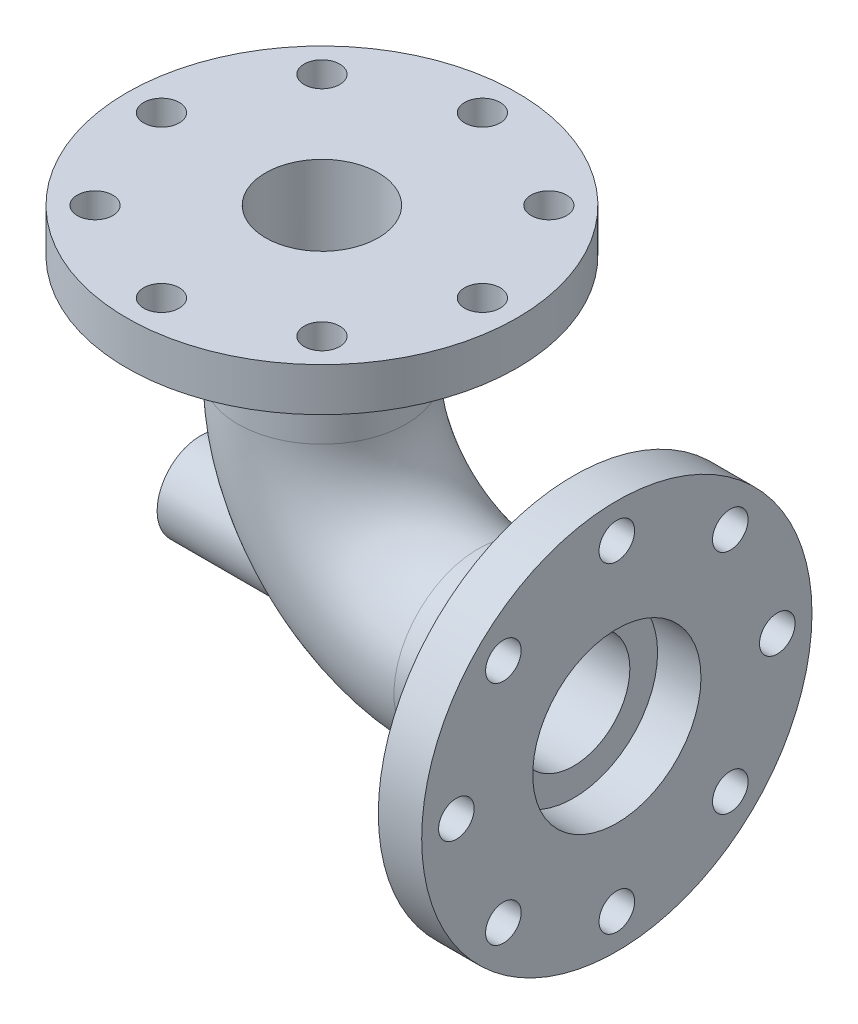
ISO-10303-21;
HEADER;
FILE_DESCRIPTION(('STEP AP214'),'2;1');
FILE_NAME('part.step','',(''),(''),'','','');
FILE_SCHEMA(('AUTOMOTIVE_DESIGN { 1 0 10303 214 1 1 1 1 }'));
ENDSEC;
DATA;
#1=APPLICATION_CONTEXT('core data for automotive mechanical design processes');
#2=APPLICATION_PROTOCOL_DEFINITION('international standard','automotive_design',2000,#1);
#3=PRODUCT_CONTEXT('',#1,'mechanical');
#4=PRODUCT('Part','Part','',(#3));
#5=PRODUCT_RELATED_PRODUCT_CATEGORY('part','',(#4));
#6=PRODUCT_DEFINITION_FORMATION('','',#4);
#7=PRODUCT_DEFINITION_CONTEXT('part definition',#1,'design');
#8=PRODUCT_DEFINITION('design','',#6,#7);
#9=PRODUCT_DEFINITION_SHAPE('','',#8);
#10=(LENGTH_UNIT() NAMED_UNIT(*) SI_UNIT(.MILLI.,.METRE.));
#11=(NAMED_UNIT(*) PLANE_ANGLE_UNIT() SI_UNIT($,.RADIAN.));
#12=(NAMED_UNIT(*) SI_UNIT($,.STERADIAN.) SOLID_ANGLE_UNIT());
#13=UNCERTAINTY_MEASURE_WITH_UNIT(LENGTH_MEASURE(1.E-05),#10,'distance_accuracy_value','');
#14=(GEOMETRIC_REPRESENTATION_CONTEXT(3) GLOBAL_UNCERTAINTY_ASSIGNED_CONTEXT((#13)) GLOBAL_UNIT_ASSIGNED_CONTEXT((#10,
#11,#12)) REPRESENTATION_CONTEXT('',''));
#15=CARTESIAN_POINT('',(0.,0.,0.));
#16=DIRECTION('',(0.,0.,1.));
#17=DIRECTION('',(1.,0.,0.));
#18=AXIS2_PLACEMENT_3D('',#15,#16,#17);
#19=CARTESIAN_POINT('',(80.,-90.,0.));
#20=DIRECTION('',(1.,0.,0.));
#21=DIRECTION('',(0.,0.,-1.));
#22=AXIS2_PLACEMENT_3D('',#19,#20,#21);
#23=PLANE('',#22);
#24=CARTESIAN_POINT('',(80.,-155.407377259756,65.4073772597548));
#25=DIRECTION('',(1.,0.,0.));
#26=DIRECTION('',(0.,-0.707106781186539,-0.707106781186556));
#27=AXIS2_PLACEMENT_3D('',#24,#25,#26);
#28=CIRCLE('',#27,10.25);
#29=CARTESIAN_POINT('',(80.,-162.655221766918,58.1595327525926));
#30=VERTEX_POINT('',#29);
#31=EDGE_CURVE('E100',#30,#30,#28,.T.);
#32=ORIENTED_EDGE('',*,*,#31,.F.);
#33=EDGE_LOOP('',(#32));
#34=FACE_BOUND('',#33,.T.);
#35=CARTESIAN_POINT('',(80.,-90.000000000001,92.5));
#36=DIRECTION('',(1.,0.,0.));
#37=DIRECTION('',(0.,-1.,0.));
#38=AXIS2_PLACEMENT_3D('',#35,#36,#37);
#39=CIRCLE('',#38,10.25);
#40=CARTESIAN_POINT('',(80.,-100.250000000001,92.4999999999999));
#41=VERTEX_POINT('',#40);
#42=EDGE_CURVE('E94',#41,#41,#39,.T.);
#43=ORIENTED_EDGE('',*,*,#42,.F.);
#44=EDGE_LOOP('',(#43));
#45=FACE_BOUND('',#44,.T.);
#46=CARTESIAN_POINT('',(80.,-24.5926227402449,65.4073772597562));
#47=DIRECTION('',(1.,0.,0.));
#48=DIRECTION('',(0.,-0.707106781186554,0.707106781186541));
#49=AXIS2_PLACEMENT_3D('',#46,#47,#48);
#50=CIRCLE('',#49,10.25);
#51=CARTESIAN_POINT('',(80.,-31.8404672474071,72.6552217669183));
#52=VERTEX_POINT('',#51);
#53=EDGE_CURVE('E88',#52,#52,#50,.T.);
#54=ORIENTED_EDGE('',*,*,#53,.F.);
#55=EDGE_LOOP('',(#54));
#56=FACE_BOUND('',#55,.T.);
#57=CARTESIAN_POINT('',(80.,2.5,6.45924421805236E-13));
#58=DIRECTION('',(1.,0.,0.));
#59=DIRECTION('',(0.,0.,1.));
#60=AXIS2_PLACEMENT_3D('',#57,#58,#59);
#61=CIRCLE('',#60,10.25);
#62=CARTESIAN_POINT('',(80.,2.49999999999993,10.2500000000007));
#63=VERTEX_POINT('',#62);
#64=EDGE_CURVE('E82',#63,#63,#61,.T.);
#65=ORIENTED_EDGE('',*,*,#64,.F.);
#66=EDGE_LOOP('',(#65));
#67=FACE_BOUND('',#66,.T.);
#68=CARTESIAN_POINT('',(80.,-24.592622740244,-65.4073772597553));
#69=DIRECTION('',(1.,0.,0.));
#70=DIRECTION('',(0.,0.707106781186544,0.707106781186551));
#71=AXIS2_PLACEMENT_3D('',#68,#69,#70);
#72=CIRCLE('',#71,10.25);
#73=CARTESIAN_POINT('',(80.,-17.3447782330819,-58.1595327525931));
#74=VERTEX_POINT('',#73);
#75=EDGE_CURVE('E76',#74,#74,#72,.T.);
#76=ORIENTED_EDGE('',*,*,#75,.F.);
#77=EDGE_LOOP('',(#76));
#78=FACE_BOUND('',#77,.T.);
#79=CARTESIAN_POINT('',(80.,-89.9999999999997,-92.5));
#80=DIRECTION('',(1.,0.,0.));
#81=DIRECTION('',(0.,1.,0.));
#82=AXIS2_PLACEMENT_3D('',#79,#80,#81);
#83=CIRCLE('',#82,10.25);
#84=CARTESIAN_POINT('',(80.,-79.7499999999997,-92.5));
#85=VERTEX_POINT('',#84);
#86=EDGE_CURVE('E70',#85,#85,#83,.T.);
#87=ORIENTED_EDGE('',*,*,#86,.F.);
#88=EDGE_LOOP('',(#87));
#89=FACE_BOUND('',#88,.T.);
#90=CARTESIAN_POINT('',(80.,-155.407377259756,-65.4073772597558));
#91=DIRECTION('',(1.,0.,0.));
#92=DIRECTION('',(0.,0.707106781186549,-0.707106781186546));
#93=AXIS2_PLACEMENT_3D('',#90,#91,#92);
#94=CIRCLE('',#93,10.25);
#95=CARTESIAN_POINT('',(80.,-148.159532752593,-72.6552217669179));
#96=VERTEX_POINT('',#95);
#97=EDGE_CURVE('E64',#96,#96,#94,.T.);
#98=ORIENTED_EDGE('',*,*,#97,.F.);
#99=EDGE_LOOP('',(#98));
#100=FACE_BOUND('',#99,.T.);
#101=CARTESIAN_POINT('',(80.,-182.5,0.));
#102=DIRECTION('',(1.,0.,0.));
#103=DIRECTION('',(0.,0.,-1.));
#104=AXIS2_PLACEMENT_3D('',#101,#102,#103);
#105=CIRCLE('',#104,10.25);
#106=CARTESIAN_POINT('',(80.,-182.5,-10.25));
#107=VERTEX_POINT('',#106);
#108=EDGE_CURVE('E58',#107,#107,#105,.T.);
#109=ORIENTED_EDGE('',*,*,#108,.F.);
#110=EDGE_LOOP('',(#109));
#111=FACE_BOUND('',#110,.T.);
#112=CARTESIAN_POINT('',(80.,-90.,0.));
#113=DIRECTION('',(1.,0.,0.));
#114=DIRECTION('',(0.,0.,-1.));
#115=AXIS2_PLACEMENT_3D('',#112,#113,#114);
#116=CIRCLE('',#115,112.5);
#117=CARTESIAN_POINT('',(80.,-90.,-112.5));
#118=VERTEX_POINT('',#117);
#119=EDGE_CURVE('E11',#118,#118,#116,.T.);
#120=ORIENTED_EDGE('',*,*,#119,.T.);
#121=EDGE_LOOP('',(#120));
#122=FACE_BOUND('',#121,.T.);
#123=CARTESIAN_POINT('',(80.,-90.,0.));
#124=DIRECTION('',(1.,0.,0.));
#125=DIRECTION('',(0.,0.,-1.));
#126=AXIS2_PLACEMENT_3D('',#123,#124,#125);
#127=CIRCLE('',#126,48.5);
#128=CARTESIAN_POINT('',(80.,-90.,-48.5));
#129=VERTEX_POINT('',#128);
#130=EDGE_CURVE('E48',#129,#129,#127,.T.);
#131=ORIENTED_EDGE('',*,*,#130,.F.);
#132=EDGE_LOOP('',(#131));
#133=FACE_BOUND('',#132,.T.);
#134=ADVANCED_FACE('F37',(#34,#45,#56,#67,#78,#89,#100,#111,#122,#133),#23,.T.);
#135=CARTESIAN_POINT('',(55.,-90.,0.));
#136=DIRECTION('',(1.,0.,0.));
#137=DIRECTION('',(0.,0.,-1.));
#138=AXIS2_PLACEMENT_3D('',#135,#136,#137);
#139=PLANE('',#138);
#140=CARTESIAN_POINT('',(55.,-155.407377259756,65.4073772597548));
#141=DIRECTION('',(1.,0.,0.));
#142=DIRECTION('',(0.,0.,-1.));
#143=AXIS2_PLACEMENT_3D('',#140,#141,#142);
#144=CIRCLE('',#143,10.25);
#145=CARTESIAN_POINT('',(55.,-155.407377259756,55.1573772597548));
#146=VERTEX_POINT('',#145);
#147=EDGE_CURVE('E97',#146,#146,#144,.F.);
#148=ORIENTED_EDGE('',*,*,#147,.F.);
#149=EDGE_LOOP('',(#148));
#150=FACE_BOUND('',#149,.T.);
#151=CARTESIAN_POINT('',(55.,-90.000000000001,92.5));
#152=DIRECTION('',(1.,0.,0.));
#153=DIRECTION('',(0.,0.,-1.));
#154=AXIS2_PLACEMENT_3D('',#151,#152,#153);
#155=CIRCLE('',#154,10.25);
#156=CARTESIAN_POINT('',(55.,-90.000000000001,82.25));
#157=VERTEX_POINT('',#156);
#158=EDGE_CURVE('E91',#157,#157,#155,.F.);
#159=ORIENTED_EDGE('',*,*,#158,.F.);
#160=EDGE_LOOP('',(#159));
#161=FACE_BOUND('',#160,.T.);
#162=CARTESIAN_POINT('',(55.,-24.5926227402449,65.4073772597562));
#163=DIRECTION('',(1.,0.,0.));
#164=DIRECTION('',(0.,0.,-1.));
#165=AXIS2_PLACEMENT_3D('',#162,#163,#164);
#166=CIRCLE('',#165,10.25);
#167=CARTESIAN_POINT('',(55.,-24.5926227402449,55.1573772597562));
#168=VERTEX_POINT('',#167);
#169=EDGE_CURVE('E85',#168,#168,#166,.F.);
#170=ORIENTED_EDGE('',*,*,#169,.F.);
#171=EDGE_LOOP('',(#170));
#172=FACE_BOUND('',#171,.T.);
#173=CARTESIAN_POINT('',(55.,2.5,6.45924421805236E-13));
#174=DIRECTION('',(1.,0.,0.));
#175=DIRECTION('',(0.,0.,-1.));
#176=AXIS2_PLACEMENT_3D('',#173,#174,#175);
#177=CIRCLE('',#176,10.25);
#178=CARTESIAN_POINT('',(55.,2.5,-10.2499999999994));
#179=VERTEX_POINT('',#178);
#180=EDGE_CURVE('E79',#179,#179,#177,.F.);
#181=ORIENTED_EDGE('',*,*,#180,.F.);
#182=EDGE_LOOP('',(#181));
#183=FACE_BOUND('',#182,.T.);
#184=CARTESIAN_POINT('',(55.,-24.592622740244,-65.4073772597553));
#185=DIRECTION('',(1.,0.,0.));
#186=DIRECTION('',(0.,0.,-1.));
#187=AXIS2_PLACEMENT_3D('',#184,#185,#186);
#188=CIRCLE('',#187,10.25);
#189=CARTESIAN_POINT('',(55.,-24.592622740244,-75.6573772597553));
#190=VERTEX_POINT('',#189);
#191=EDGE_CURVE('E73',#190,#190,#188,.F.);
#192=ORIENTED_EDGE('',*,*,#191,.F.);
#193=EDGE_LOOP('',(#192));
#194=FACE_BOUND('',#193,.T.);
#195=CARTESIAN_POINT('',(55.,-89.9999999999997,-92.5));
#196=DIRECTION('',(1.,0.,0.));
#197=DIRECTION('',(0.,0.,-1.));
#198=AXIS2_PLACEMENT_3D('',#195,#196,#197);
#199=CIRCLE('',#198,10.25);
#200=CARTESIAN_POINT('',(55.,-89.9999999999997,-102.75));
#201=VERTEX_POINT('',#200);
#202=EDGE_CURVE('E67',#201,#201,#199,.F.);
#203=ORIENTED_EDGE('',*,*,#202,.F.);
#204=EDGE_LOOP('',(#203));
#205=FACE_BOUND('',#204,.T.);
#206=CARTESIAN_POINT('',(55.,-155.407377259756,-65.4073772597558));
#207=DIRECTION('',(1.,0.,0.));
#208=DIRECTION('',(0.,0.,-1.));
#209=AXIS2_PLACEMENT_3D('',#206,#207,#208);
#210=CIRCLE('',#209,10.25);
#211=CARTESIAN_POINT('',(55.,-155.407377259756,-75.6573772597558));
#212=VERTEX_POINT('',#211);
#213=EDGE_CURVE('E61',#212,#212,#210,.F.);
#214=ORIENTED_EDGE('',*,*,#213,.F.);
#215=EDGE_LOOP('',(#214));
#216=FACE_BOUND('',#215,.T.);
#217=CARTESIAN_POINT('',(55.,-182.5,0.));
#218=DIRECTION('',(1.,0.,0.));
#219=DIRECTION('',(0.,0.,-1.));
#220=AXIS2_PLACEMENT_3D('',#217,#218,#219);
#221=CIRCLE('',#220,10.25);
#222=CARTESIAN_POINT('',(55.,-182.5,-10.25));
#223=VERTEX_POINT('',#222);
#224=EDGE_CURVE('E53',#223,#223,#221,.F.);
#225=ORIENTED_EDGE('',*,*,#224,.F.);
#226=EDGE_LOOP('',(#225));
#227=FACE_BOUND('',#226,.T.);
#228=CARTESIAN_POINT('',(55.,-90.,0.));
#229=DIRECTION('',(1.,0.,0.));
#230=DIRECTION('',(0.,0.,-1.));
#231=AXIS2_PLACEMENT_3D('',#228,#229,#230);
#232=CIRCLE('',#231,112.5);
#233=CARTESIAN_POINT('',(55.,-90.,-112.5));
#234=VERTEX_POINT('',#233);
#235=EDGE_CURVE('E41',#234,#234,#232,.T.);
#236=ORIENTED_EDGE('',*,*,#235,.F.);
#237=EDGE_LOOP('',(#236));
#238=FACE_BOUND('',#237,.T.);
#239=CARTESIAN_POINT('',(55.,-90.,0.));
#240=DIRECTION('',(1.,0.,0.));
#241=DIRECTION('',(0.,0.,-1.));
#242=AXIS2_PLACEMENT_3D('',#239,#240,#241);
#243=CIRCLE('',#242,48.5);
#244=CARTESIAN_POINT('',(55.,-90.,-48.5));
#245=VERTEX_POINT('',#244);
#246=EDGE_CURVE('E50',#245,#245,#243,.T.);
#247=ORIENTED_EDGE('',*,*,#246,.T.);
#248=EDGE_LOOP('',(#247));
#249=FACE_BOUND('',#248,.T.);
#250=ADVANCED_FACE('F109',(#150,#161,#172,#183,#194,#205,#216,#227,#238,#249),#139,.F.);
#251=CARTESIAN_POINT('',(80.,-90.,0.));
#252=DIRECTION('',(-1.,0.,0.));
#253=DIRECTION('',(0.,0.,1.));
#254=AXIS2_PLACEMENT_3D('',#251,#252,#253);
#255=CYLINDRICAL_SURFACE('',#254,112.5);
#256=ORIENTED_EDGE('',*,*,#119,.F.);
#257=EDGE_LOOP('',(#256));
#258=FACE_BOUND('',#257,.T.);
#259=ORIENTED_EDGE('',*,*,#235,.T.);
#260=EDGE_LOOP('',(#259));
#261=FACE_BOUND('',#260,.T.);
#262=ADVANCED_FACE('F39',(#258,#261),#255,.T.);
#263=CARTESIAN_POINT('',(80.,-90.,0.));
#264=DIRECTION('',(-1.,0.,0.));
#265=DIRECTION('',(0.,0.,1.));
#266=AXIS2_PLACEMENT_3D('',#263,#264,#265);
#267=CYLINDRICAL_SURFACE('',#266,48.5);
#268=ORIENTED_EDGE('',*,*,#130,.T.);
#269=EDGE_LOOP('',(#268));
#270=FACE_BOUND('',#269,.T.);
#271=ORIENTED_EDGE('',*,*,#246,.F.);
#272=EDGE_LOOP('',(#271));
#273=FACE_BOUND('',#272,.T.);
#274=ADVANCED_FACE('F127',(#270,#273),#267,.F.);
#275=CARTESIAN_POINT('',(-202.501,-182.5,0.));
#276=DIRECTION('',(1.,0.,0.));
#277=DIRECTION('',(0.,0.,-1.));
#278=AXIS2_PLACEMENT_3D('',#275,#276,#277);
#279=CYLINDRICAL_SURFACE('',#278,10.25);
#280=ORIENTED_EDGE('',*,*,#108,.T.);
#281=EDGE_LOOP('',(#280));
#282=FACE_BOUND('',#281,.T.);
#283=ORIENTED_EDGE('',*,*,#224,.T.);
#284=EDGE_LOOP('',(#283));
#285=FACE_BOUND('',#284,.T.);
#286=ADVANCED_FACE('F130',(#282,#285),#279,.F.);
#287=CARTESIAN_POINT('',(54.999,-155.407377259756,-65.4073772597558));
#288=DIRECTION('',(1.,0.,0.));
#289=DIRECTION('',(0.,0.,-1.));
#290=AXIS2_PLACEMENT_3D('',#287,#288,#289);
#291=CYLINDRICAL_SURFACE('',#290,10.25);
#292=ORIENTED_EDGE('',*,*,#97,.T.);
#293=EDGE_LOOP('',(#292));
#294=FACE_BOUND('',#293,.T.);
#295=ORIENTED_EDGE('',*,*,#213,.T.);
#296=EDGE_LOOP('',(#295));
#297=FACE_BOUND('',#296,.T.);
#298=ADVANCED_FACE('F145',(#294,#297),#291,.F.);
#299=CARTESIAN_POINT('',(54.999,-89.9999999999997,-92.5));
#300=DIRECTION('',(1.,0.,0.));
#301=DIRECTION('',(0.,0.,-1.));
#302=AXIS2_PLACEMENT_3D('',#299,#300,#301);
#303=CYLINDRICAL_SURFACE('',#302,10.25);
#304=ORIENTED_EDGE('',*,*,#86,.T.);
#305=EDGE_LOOP('',(#304));
#306=FACE_BOUND('',#305,.T.);
#307=ORIENTED_EDGE('',*,*,#202,.T.);
#308=EDGE_LOOP('',(#307));
#309=FACE_BOUND('',#308,.T.);
#310=ADVANCED_FACE('F149',(#306,#309),#303,.F.);
#311=CARTESIAN_POINT('',(54.999,-24.592622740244,-65.4073772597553));
#312=DIRECTION('',(1.,0.,0.));
#313=DIRECTION('',(0.,0.,-1.));
#314=AXIS2_PLACEMENT_3D('',#311,#312,#313);
#315=CYLINDRICAL_SURFACE('',#314,10.25);
#316=ORIENTED_EDGE('',*,*,#75,.T.);
#317=EDGE_LOOP('',(#316));
#318=FACE_BOUND('',#317,.T.);
#319=ORIENTED_EDGE('',*,*,#191,.T.);
#320=EDGE_LOOP('',(#319));
#321=FACE_BOUND('',#320,.T.);
#322=ADVANCED_FACE('F153',(#318,#321),#315,.F.);
#323=CARTESIAN_POINT('',(54.999,2.5,6.45924421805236E-13));
#324=DIRECTION('',(1.,0.,0.));
#325=DIRECTION('',(0.,0.,-1.));
#326=AXIS2_PLACEMENT_3D('',#323,#324,#325);
#327=CYLINDRICAL_SURFACE('',#326,10.25);
#328=ORIENTED_EDGE('',*,*,#64,.T.);
#329=EDGE_LOOP('',(#328));
#330=FACE_BOUND('',#329,.T.);
#331=ORIENTED_EDGE('',*,*,#180,.T.);
#332=EDGE_LOOP('',(#331));
#333=FACE_BOUND('',#332,.T.);
#334=ADVANCED_FACE('F157',(#330,#333),#327,.F.);
#335=CARTESIAN_POINT('',(54.999,-24.5926227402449,65.4073772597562));
#336=DIRECTION('',(1.,0.,0.));
#337=DIRECTION('',(0.,0.,-1.));
#338=AXIS2_PLACEMENT_3D('',#335,#336,#337);
#339=CYLINDRICAL_SURFACE('',#338,10.25);
#340=ORIENTED_EDGE('',*,*,#53,.T.);
#341=EDGE_LOOP('',(#340));
#342=FACE_BOUND('',#341,.T.);
#343=ORIENTED_EDGE('',*,*,#169,.T.);
#344=EDGE_LOOP('',(#343));
#345=FACE_BOUND('',#344,.T.);
#346=ADVANCED_FACE('F161',(#342,#345),#339,.F.);
#347=CARTESIAN_POINT('',(54.999,-90.000000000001,92.5));
#348=DIRECTION('',(1.,0.,0.));
#349=DIRECTION('',(0.,0.,-1.));
#350=AXIS2_PLACEMENT_3D('',#347,#348,#349);
#351=CYLINDRICAL_SURFACE('',#350,10.25);
#352=ORIENTED_EDGE('',*,*,#42,.T.);
#353=EDGE_LOOP('',(#352));
#354=FACE_BOUND('',#353,.T.);
#355=ORIENTED_EDGE('',*,*,#158,.T.);
#356=EDGE_LOOP('',(#355));
#357=FACE_BOUND('',#356,.T.);
#358=ADVANCED_FACE('F165',(#354,#357),#351,.F.);
#359=CARTESIAN_POINT('',(54.999,-155.407377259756,65.4073772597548));
#360=DIRECTION('',(1.,0.,0.));
#361=DIRECTION('',(0.,0.,-1.));
#362=AXIS2_PLACEMENT_3D('',#359,#360,#361);
#363=CYLINDRICAL_SURFACE('',#362,10.25);
#364=ORIENTED_EDGE('',*,*,#31,.T.);
#365=EDGE_LOOP('',(#364));
#366=FACE_BOUND('',#365,.T.);
#367=ORIENTED_EDGE('',*,*,#147,.T.);
#368=EDGE_LOOP('',(#367));
#369=FACE_BOUND('',#368,.T.);
#370=ADVANCED_FACE('F104',(#366,#369),#363,.F.);
#371=CLOSED_SHELL('',(#134,#250,#262,#274,#286,#298,#310,#322,#334,#346,#358,#370));
#372=MANIFOLD_SOLID_BREP('B2',#371);
#373=CARTESIAN_POINT('',(0.,0.,0.));
#374=DIRECTION('',(0.,0.,-1.));
#375=DIRECTION('',(-1.,0.,0.));
#376=AXIS2_PLACEMENT_3D('',#373,#374,#375);
#377=TOROIDAL_SURFACE('',#376,90.,48.5);
#378=CARTESIAN_POINT('',(-90.,0.,0.));
#379=DIRECTION('',(0.,-1.,0.));
#380=DIRECTION('',(0.,0.,-1.));
#381=AXIS2_PLACEMENT_3D('',#378,#379,#380);
#382=CIRCLE('',#381,48.5);
#383=CARTESIAN_POINT('',(-90.,0.,-48.5));
#384=VERTEX_POINT('',#383);
#385=EDGE_CURVE('E281',#384,#384,#382,.T.);
#386=ORIENTED_EDGE('',*,*,#385,.T.);
#387=EDGE_LOOP('',(#386));
#388=FACE_BOUND('',#387,.T.);
#389=CARTESIAN_POINT('',(0.,-90.,0.));
#390=DIRECTION('',(1.,0.,0.));
#391=DIRECTION('',(0.,0.,-1.));
#392=AXIS2_PLACEMENT_3D('',#389,#390,#391);
#393=CIRCLE('',#392,48.5);
#394=CARTESIAN_POINT('',(0.,-90.,-48.5));
#395=VERTEX_POINT('',#394);
#396=EDGE_CURVE('E285',#395,#395,#393,.T.);
#397=ORIENTED_EDGE('',*,*,#396,.F.);
#398=EDGE_LOOP('',(#397));
#399=FACE_BOUND('',#398,.T.);
#400=CARTESIAN_POINT('',(-89.8449299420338,-96.875919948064,-24.035842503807));
#401=CARTESIAN_POINT('',(-89.2825330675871,-97.5468685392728,-23.8439036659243));
#402=CARTESIAN_POINT('',(-88.7304253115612,-98.2179177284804,-23.621553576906));
#403=CARTESIAN_POINT('',(-87.6507002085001,-99.5556563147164,-23.1128027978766));
#404=CARTESIAN_POINT('',(-87.1230864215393,-100.222345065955,-22.8263928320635));
#405=CARTESIAN_POINT('',(-86.0965582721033,-101.545396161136,-22.186554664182));
#406=CARTESIAN_POINT('',(-85.5976305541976,-102.201763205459,-21.8331579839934));
#407=CARTESIAN_POINT('',(-84.8738989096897,-103.173123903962,-21.2511488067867));
#408=CARTESIAN_POINT('',(-84.6367783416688,-103.494693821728,-21.048506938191));
#409=CARTESIAN_POINT('',(-84.1711191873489,-104.132603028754,-20.6256153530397));
#410=CARTESIAN_POINT('',(-83.9425828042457,-104.448940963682,-20.4053611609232));
#411=CARTESIAN_POINT('',(-83.3555767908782,-105.269697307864,-19.804842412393));
#412=CARTESIAN_POINT('',(-83.0045200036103,-105.768962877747,-19.4101271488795));
#413=CARTESIAN_POINT('',(-82.328599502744,-106.745583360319,-18.5741364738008));
#414=CARTESIAN_POINT('',(-82.0037307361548,-107.222942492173,-18.1328700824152));
#415=CARTESIAN_POINT('',(-81.3820615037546,-108.150413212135,-17.2044431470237));
#416=CARTESIAN_POINT('',(-81.0852548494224,-108.600530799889,-16.7172927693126));
#417=CARTESIAN_POINT('',(-80.5213707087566,-109.468010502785,-15.6985392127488));
#418=CARTESIAN_POINT('',(-80.2542937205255,-109.885372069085,-15.1669352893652));
#419=CARTESIAN_POINT('',(-79.7498574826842,-110.684098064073,-14.0583638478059));
#420=CARTESIAN_POINT('',(-79.5126893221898,-111.065227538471,-13.4811395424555));
#421=CARTESIAN_POINT('',(-79.0712894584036,-111.782983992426,-12.2876549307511));
#422=CARTESIAN_POINT('',(-78.8670584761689,-112.119609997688,-11.6713937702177));
#423=CARTESIAN_POINT('',(-78.4926410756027,-112.743040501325,-10.4044434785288));
#424=CARTESIAN_POINT('',(-78.3224466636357,-113.029856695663,-9.7537624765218));
#425=CARTESIAN_POINT('',(-78.0168742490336,-113.549091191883,-8.4231903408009));
#426=CARTESIAN_POINT('',(-77.8814922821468,-113.781515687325,-7.74330254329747));
#427=CARTESIAN_POINT('',(-77.6586541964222,-114.166479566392,-6.43398877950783));
#428=CARTESIAN_POINT('',(-77.5676323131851,-114.324886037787,-5.8068862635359));
#429=CARTESIAN_POINT('',(-77.4141521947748,-114.593042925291,-4.53894506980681));
#430=CARTESIAN_POINT('',(-77.3516918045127,-114.702797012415,-3.89810743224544));
#431=CARTESIAN_POINT('',(-77.2555422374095,-114.872111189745,-2.60792644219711));
#432=CARTESIAN_POINT('',(-77.2218432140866,-114.931688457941,-1.95858607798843));
#433=CARTESIAN_POINT('',(-77.18328099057,-114.999884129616,-0.65638216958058));
#434=CARTESIAN_POINT('',(-77.1784170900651,-115.00850377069,-0.00351871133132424));
#435=CARTESIAN_POINT('',(-77.1970068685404,-114.975609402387,1.26436086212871));
#436=CARTESIAN_POINT('',(-77.2189093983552,-114.936841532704,1.87947334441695));
#437=CARTESIAN_POINT('',(-77.2883974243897,-114.814218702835,3.10369888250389));
#438=CARTESIAN_POINT('',(-77.3359816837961,-114.730365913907,3.71281222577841));
#439=CARTESIAN_POINT('',(-77.4566949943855,-114.518622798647,4.92067552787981));
#440=CARTESIAN_POINT('',(-77.5298208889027,-114.390737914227,5.51942675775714));
#441=CARTESIAN_POINT('',(-77.7014100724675,-114.092490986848,6.70254179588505));
#442=CARTESIAN_POINT('',(-77.7998737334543,-113.922128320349,7.28690539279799));
#443=CARTESIAN_POINT('',(-78.0219992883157,-113.540702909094,8.4382226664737));
#444=CARTESIAN_POINT('',(-78.1456974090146,-113.3295816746,9.00514994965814));
#445=CARTESIAN_POINT('',(-78.4177997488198,-112.869297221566,10.1171822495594));
#446=CARTESIAN_POINT('',(-78.5662037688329,-112.620134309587,10.6622874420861));
#447=CARTESIAN_POINT('',(-78.8872148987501,-112.086610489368,11.7275979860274));
#448=CARTESIAN_POINT('',(-79.0598236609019,-111.802247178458,12.2478016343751));
#449=CARTESIAN_POINT('',(-79.4286014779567,-111.201485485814,13.2606082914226));
#450=CARTESIAN_POINT('',(-79.6247712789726,-110.885086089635,13.7532104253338));
#451=CARTESIAN_POINT('',(-80.0506281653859,-110.206525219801,14.7332842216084));
#452=CARTESIAN_POINT('',(-80.2815225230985,-109.84284476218,15.2191791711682));
#453=CARTESIAN_POINT('',(-80.7674875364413,-109.087789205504,16.1560616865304));
#454=CARTESIAN_POINT('',(-81.0225588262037,-108.6964133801,16.6070483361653));
#455=CARTESIAN_POINT('',(-81.5557232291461,-107.889965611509,17.4728118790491));
#456=CARTESIAN_POINT('',(-81.8338186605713,-107.474891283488,17.8875851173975));
#457=CARTESIAN_POINT('',(-82.4117279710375,-106.624980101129,18.680143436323));
#458=CARTESIAN_POINT('',(-82.7115446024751,-106.190140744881,19.0579238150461));
#459=CARTESIAN_POINT('',(-83.3663653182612,-105.254621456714,19.8166313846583));
#460=CARTESIAN_POINT('',(-83.7237831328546,-104.752038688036,20.1931292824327));
#461=CARTESIAN_POINT('',(-84.4616847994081,-103.731847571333,20.9002792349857));
#462=CARTESIAN_POINT('',(-84.8421697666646,-103.214238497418,21.2309290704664));
#463=CARTESIAN_POINT('',(-85.6242935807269,-102.167970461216,21.8474119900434));
#464=CARTESIAN_POINT('',(-86.0259438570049,-101.639305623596,22.1332205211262));
#465=CARTESIAN_POINT('',(-86.8481657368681,-100.574784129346,22.6611342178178));
#466=CARTESIAN_POINT('',(-87.2687409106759,-100.038926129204,22.9032310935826));
#467=CARTESIAN_POINT('',(-88.0215438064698,-99.095017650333,23.2910591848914));
#468=CARTESIAN_POINT('',(-88.3501870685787,-98.6878015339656,23.4458710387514));
#469=CARTESIAN_POINT('',(-89.0160615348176,-97.8723336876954,23.7321102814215));
#470=CARTESIAN_POINT('',(-89.3532913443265,-97.4640821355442,23.8635414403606));
#471=CARTESIAN_POINT('',(-90.3769650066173,-96.2388170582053,24.2240039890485));
#472=CARTESIAN_POINT('',(-91.075234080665,-95.4214924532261,24.4191236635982));
#473=CARTESIAN_POINT('',(-92.4973777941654,-93.7915270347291,24.7247495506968));
#474=CARTESIAN_POINT('',(-93.2212904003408,-92.9788954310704,24.8351243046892));
#475=CARTESIAN_POINT('',(-94.6876879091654,-91.3637986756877,24.9759287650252));
#476=CARTESIAN_POINT('',(-95.4301709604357,-90.5613325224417,25.0063664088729));
#477=CARTESIAN_POINT('',(-96.9439834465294,-88.9526616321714,24.9912743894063));
#478=CARTESIAN_POINT('',(-97.7155908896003,-88.1467363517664,24.9441255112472));
#479=CARTESIAN_POINT('',(-99.2668088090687,-86.5507680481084,24.7739148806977));
#480=CARTESIAN_POINT('',(-100.04641968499,-85.7607258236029,24.6508493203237));
#481=CARTESIAN_POINT('',(-101.608315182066,-84.1983037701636,24.3305646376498));
#482=CARTESIAN_POINT('',(-102.390600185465,-83.4259265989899,24.1333344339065));
#483=CARTESIAN_POINT('',(-103.95225140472,-81.9008503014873,23.6651647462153));
#484=CARTESIAN_POINT('',(-104.731617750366,-81.1481502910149,23.3942285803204));
#485=CARTESIAN_POINT('',(-106.278537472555,-79.6676890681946,22.7790103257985));
#486=CARTESIAN_POINT('',(-107.046126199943,-78.9398381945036,22.4350337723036));
#487=CARTESIAN_POINT('',(-108.566567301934,-77.5087171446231,21.6708553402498));
#488=CARTESIAN_POINT('',(-109.319417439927,-76.8054506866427,21.2506419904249));
#489=CARTESIAN_POINT('',(-110.801945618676,-75.4286836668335,20.3312856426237));
#490=CARTESIAN_POINT('',(-111.531651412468,-74.7551470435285,19.8322418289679));
#491=CARTESIAN_POINT('',(-112.959739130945,-73.4429670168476,18.7506565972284));
#492=CARTESIAN_POINT('',(-113.658136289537,-72.8043066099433,18.1681563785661));
#493=CARTESIAN_POINT('',(-114.776704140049,-71.7848842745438,17.1329552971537));
#494=CARTESIAN_POINT('',(-115.209129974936,-71.3917081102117,16.7056127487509));
#495=CARTESIAN_POINT('',(-116.052136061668,-70.6266106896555,15.8119500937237));
#496=CARTESIAN_POINT('',(-116.462717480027,-70.2546882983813,15.3456320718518));
#497=CARTESIAN_POINT('',(-117.256988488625,-69.5362369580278,14.3735588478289));
#498=CARTESIAN_POINT('',(-117.640713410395,-69.1896746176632,13.8678573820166));
#499=CARTESIAN_POINT('',(-118.376703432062,-68.5256972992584,12.815662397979));
#500=CARTESIAN_POINT('',(-118.728965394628,-68.2082852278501,12.2691648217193));
#501=CARTESIAN_POINT('',(-119.323014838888,-67.6734465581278,11.2594986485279));
#502=CARTESIAN_POINT('',(-119.572131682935,-67.4493195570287,10.8041833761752));
#503=CARTESIAN_POINT('',(-120.044050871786,-67.0249544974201,9.8696715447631));
#504=CARTESIAN_POINT('',(-120.266867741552,-66.8247032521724,9.39048837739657));
#505=CARTESIAN_POINT('',(-120.682901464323,-66.450944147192,8.40936763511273));
#506=CARTESIAN_POINT('',(-120.876121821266,-66.2774331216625,7.90743276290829));
#507=CARTESIAN_POINT('',(-121.229529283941,-65.9601608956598,6.88285373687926));
#508=CARTESIAN_POINT('',(-121.389716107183,-65.816399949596,6.36020940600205));
#509=CARTESIAN_POINT('',(-121.675149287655,-65.5602827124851,5.29195946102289));
#510=CARTESIAN_POINT('',(-121.800030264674,-65.4482548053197,4.74617651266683));
#511=CARTESIAN_POINT('',(-122.009707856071,-65.260178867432,3.64080679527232));
#512=CARTESIAN_POINT('',(-122.094504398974,-65.1841309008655,3.08122000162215));
#513=CARTESIAN_POINT('',(-122.221733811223,-65.0700338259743,1.95384436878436));
#514=CARTESIAN_POINT('',(-122.264200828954,-65.031954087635,1.38606251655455));
#515=CARTESIAN_POINT('',(-122.305697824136,-64.9947440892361,0.247677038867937));
#516=CARTESIAN_POINT('',(-122.304734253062,-64.9956080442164,-0.322926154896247));
#517=CARTESIAN_POINT('',(-122.262873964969,-65.0331439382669,-1.37464340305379));
#518=CARTESIAN_POINT('',(-122.228051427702,-65.0643691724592,-1.85621388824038));
#519=CARTESIAN_POINT('',(-122.127908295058,-65.1541742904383,-2.81353825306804));
#520=CARTESIAN_POINT('',(-122.062591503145,-65.2127507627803,-3.28929285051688));
#521=CARTESIAN_POINT('',(-121.902696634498,-65.3561629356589,-4.23185779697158));
#522=CARTESIAN_POINT('',(-121.808115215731,-65.4410016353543,-4.6986671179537));
#523=CARTESIAN_POINT('',(-121.591374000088,-65.6354502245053,-5.62055947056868));
#524=CARTESIAN_POINT('',(-121.469212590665,-65.745061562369,-6.07564181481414));
#525=CARTESIAN_POINT('',(-121.197566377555,-65.9888572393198,-6.97753560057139));
#526=CARTESIAN_POINT('',(-121.047753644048,-66.123336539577,-7.4241680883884));
#527=CARTESIAN_POINT('',(-120.724114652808,-66.4139404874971,-8.30128669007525));
#528=CARTESIAN_POINT('',(-120.550289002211,-66.5700645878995,-8.73177321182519));
#529=CARTESIAN_POINT('',(-119.996130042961,-67.0679852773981,-9.99720214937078));
#530=CARTESIAN_POINT('',(-119.583049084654,-67.4393891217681,-10.8063262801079));
#531=CARTESIAN_POINT('',(-118.423015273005,-68.4836581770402,-12.8048196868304));
#532=CARTESIAN_POINT('',(-117.622625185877,-69.2053193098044,-13.9378008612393));
#533=CARTESIAN_POINT('',(-116.332954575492,-70.3721724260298,-15.4975033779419));
#534=CARTESIAN_POINT('',(-115.887374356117,-70.7759502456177,-15.9948427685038));
#535=CARTESIAN_POINT('',(-114.971382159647,-71.6077886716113,-16.9447519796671));
#536=CARTESIAN_POINT('',(-114.500970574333,-72.0358488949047,-17.3973225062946));
#537=CARTESIAN_POINT('',(-113.670679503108,-72.7933896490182,-18.1420261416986));
#538=CARTESIAN_POINT('',(-113.315462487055,-73.1180842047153,-18.4443598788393));
#539=CARTESIAN_POINT('',(-112.595911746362,-73.777264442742,-19.0267230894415));
#540=CARTESIAN_POINT('',(-112.231577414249,-74.1117507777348,-19.3067510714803));
#541=CARTESIAN_POINT('',(-111.126750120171,-75.1286336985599,-20.1144870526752));
#542=CARTESIAN_POINT('',(-110.374556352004,-75.8243417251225,-20.6097376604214));
#543=CARTESIAN_POINT('',(-108.847730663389,-77.2457590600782,-21.5184064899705));
#544=CARTESIAN_POINT('',(-108.073070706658,-77.9715063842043,-21.931716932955));
#545=CARTESIAN_POINT('',(-106.509829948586,-79.4480112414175,-22.679064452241));
#546=CARTESIAN_POINT('',(-105.721251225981,-80.1987650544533,-23.0131132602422));
#547=CARTESIAN_POINT('',(-104.107386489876,-81.7505320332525,-23.6149152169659));
#548=CARTESIAN_POINT('',(-103.281820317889,-82.552377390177,-23.8797646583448));
#549=CARTESIAN_POINT('',(-101.629223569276,-84.1774831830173,-24.3271165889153));
#550=CARTESIAN_POINT('',(-100.802192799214,-85.0007466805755,-24.5096072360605));
#551=CARTESIAN_POINT('',(-99.1549972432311,-86.6645875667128,-24.7908324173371));
#552=CARTESIAN_POINT('',(-98.3348214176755,-87.505123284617,-24.8897487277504));
#553=CARTESIAN_POINT('',(-96.7061053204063,-89.2027650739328,-25.0017535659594));
#554=CARTESIAN_POINT('',(-95.8975610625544,-90.059865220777,-25.0148722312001));
#555=CARTESIAN_POINT('',(-94.6452991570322,-91.4131242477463,-24.9648320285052));
#556=CARTESIAN_POINT('',(-94.1953011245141,-91.9047642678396,-24.9322603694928));
#557=CARTESIAN_POINT('',(-93.302486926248,-92.8916216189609,-24.8371547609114));
#558=CARTESIAN_POINT('',(-92.8596699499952,-93.3868385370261,-24.7746242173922));
#559=CARTESIAN_POINT('',(-91.9822842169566,-94.3802493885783,-24.6184152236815));
#560=CARTESIAN_POINT('',(-91.547720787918,-94.8784449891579,-24.5247173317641));
#561=CARTESIAN_POINT('',(-90.6885106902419,-95.8763816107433,-24.3049222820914));
#562=CARTESIAN_POINT('',(-90.2638656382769,-96.3761228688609,-24.1788198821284));
#563=CARTESIAN_POINT('',(-89.8449299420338,-96.875919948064,-24.035842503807));
#564=B_SPLINE_CURVE_WITH_KNOTS('',3,(#400,#401,#402,#403,#404,#405,#406,#407,#408,#409,#410,
#411,#412,#413,#414,#415,#416,#417,#418,#419,#420,#421,#422,#423,#424,#425,#426,#427,#428,#429,
#430,#431,#432,#433,#434,#435,#436,#437,#438,#439,#440,#441,#442,#443,#444,#445,#446,#447,#448,
#449,#450,#451,#452,#453,#454,#455,#456,#457,#458,#459,#460,#461,#462,#463,#464,#465,#466,#467,
#468,#469,#470,#471,#472,#473,#474,#475,#476,#477,#478,#479,#480,#481,#482,#483,#484,#485,#486,
#487,#488,#489,#490,#491,#492,#493,#494,#495,#496,#497,#498,#499,#500,#501,#502,#503,#504,#505,
#506,#507,#508,#509,#510,#511,#512,#513,#514,#515,#516,#517,#518,#519,#520,#521,#522,#523,#524,
#525,#526,#527,#528,#529,#530,#531,#532,#533,#534,#535,#536,#537,#538,#539,#540,#541,#542,#543,
#544,#545,#546,#547,#548,#549,#550,#551,#552,#553,#554,#555,#556,#557,#558,#559,#560,#561,#562,
#563),.UNSPECIFIED.,.T.,.F.,(4,2,2,2,2,2,2,2,2,2,2,2,2,2,2,2,2,2,2,2,2,2,2,2,2,2,2,2,2,2,2,2,2,
2,2,2,2,2,2,2,2,2,2,2,2,2,2,2,2,2,2,2,2,2,2,2,2,2,2,2,2,2,2,2,2,2,2,2,2,2,2,2,2,2,2,2,2,2,2,2,2,
4),(0.,2.68836013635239,5.3771097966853,8.06459734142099,9.40818183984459,10.75210885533,
12.9303384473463,15.1081467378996,17.2854736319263,19.4628370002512,21.6534738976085,
23.8441587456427,26.0343284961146,28.2242487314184,30.1812636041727,32.1381307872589,
34.0943277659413,36.0504772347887,37.8984473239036,39.7463284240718,41.5939812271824,
43.4416611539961,45.2920125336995,47.1423490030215,48.9928118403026,50.8433332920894,
52.789354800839,54.7354273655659,56.6816961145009,58.6282119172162,60.7937589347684,
62.9594107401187,65.1262442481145,67.293488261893,68.9300418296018,70.5663312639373,
73.8397097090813,77.1181557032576,80.3962761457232,83.7436817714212,87.0912553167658,
90.4393292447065,93.787252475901,97.1214375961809,100.456124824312,103.786649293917,
107.115535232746,109.286145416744,111.456639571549,113.624222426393,115.792021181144,
117.486578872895,119.180196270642,120.873613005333,122.567044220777,124.277407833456,
125.987774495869,127.696760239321,129.405492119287,130.855258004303,132.304843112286,
133.75459382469,135.204429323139,136.672715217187,138.140963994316,141.07677831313,
145.73999390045,148.07965349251,150.419276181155,152.123742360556,153.828322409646,
157.238079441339,160.652292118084,164.06599913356,167.605767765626,171.146045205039,
174.678602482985,178.209918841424,180.211161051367,182.212175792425,184.214441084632,
186.217030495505),.UNSPECIFIED.);
#565=CARTESIAN_POINT('',(-89.8449299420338,-96.875919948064,-24.035842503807));
#566=VERTEX_POINT('',#565);
#567=EDGE_CURVE('E36',#566,#566,#564,.T.);
#568=ORIENTED_EDGE('',*,*,#567,.F.);
#569=EDGE_LOOP('',(#568));
#570=FACE_BOUND('',#569,.T.);
#571=ADVANCED_FACE('F267',(#388,#399,#570),#377,.T.);
#572=CARTESIAN_POINT('',(-90.,0.,0.));
#573=DIRECTION('',(0.,1.,0.));
#574=DIRECTION('',(0.,0.,1.));
#575=AXIS2_PLACEMENT_3D('',#572,#573,#574);
#576=CYLINDRICAL_SURFACE('',#575,48.5);
#577=ORIENTED_EDGE('',*,*,#385,.F.);
#578=EDGE_LOOP('',(#577));
#579=FACE_BOUND('',#578,.T.);
#580=CARTESIAN_POINT('',(-90.,60.,0.));
#581=DIRECTION('',(0.,1.,0.));
#582=DIRECTION('',(-1.,0.,0.));
#583=AXIS2_PLACEMENT_3D('',#580,#581,#582);
#584=CIRCLE('',#583,48.5);
#585=CARTESIAN_POINT('',(-138.5,60.,0.));
#586=VERTEX_POINT('',#585);
#587=EDGE_CURVE('E277',#586,#586,#584,.T.);
#588=ORIENTED_EDGE('',*,*,#587,.F.);
#589=EDGE_LOOP('',(#588));
#590=FACE_BOUND('',#589,.T.);
#591=ADVANCED_FACE('F269',(#579,#590),#576,.T.);
#592=CARTESIAN_POINT('',(0.,-90.,0.));
#593=DIRECTION('',(1.,0.,0.));
#594=DIRECTION('',(0.,0.,-1.));
#595=AXIS2_PLACEMENT_3D('',#592,#593,#594);
#596=CYLINDRICAL_SURFACE('',#595,48.5);
#597=ORIENTED_EDGE('',*,*,#396,.T.);
#598=EDGE_LOOP('',(#597));
#599=FACE_BOUND('',#598,.T.);
#600=CARTESIAN_POINT('',(55.,-90.,0.));
#601=DIRECTION('',(1.,0.,0.));
#602=DIRECTION('',(0.,0.,-1.));
#603=AXIS2_PLACEMENT_3D('',#600,#601,#602);
#604=CIRCLE('',#603,48.5);
#605=CARTESIAN_POINT('',(55.,-90.,-48.5));
#606=VERTEX_POINT('',#605);
#607=EDGE_CURVE('E288',#606,#606,#604,.T.);
#608=ORIENTED_EDGE('',*,*,#607,.F.);
#609=EDGE_LOOP('',(#608));
#610=FACE_BOUND('',#609,.T.);
#611=ADVANCED_FACE('F380',(#599,#610),#596,.T.);
#612=CARTESIAN_POINT('',(-90.,85.,0.));
#613=DIRECTION('',(0.,-1.,0.));
#614=DIRECTION('',(0.,0.,-1.));
#615=AXIS2_PLACEMENT_3D('',#612,#613,#614);
#616=PLANE('',#615);
#617=CARTESIAN_POINT('',(-24.5926227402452,85.,-65.4073772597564));
#618=DIRECTION('',(0.,1.,0.));
#619=DIRECTION('',(-0.707106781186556,0.,-0.707106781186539));
#620=AXIS2_PLACEMENT_3D('',#617,#618,#619);
#621=CIRCLE('',#620,10.25);
#622=CARTESIAN_POINT('',(-31.8404672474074,85.,-72.6552217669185));
#623=VERTEX_POINT('',#622);
#624=EDGE_CURVE('E477',#623,#623,#621,.T.);
#625=ORIENTED_EDGE('',*,*,#624,.F.);
#626=EDGE_LOOP('',(#625));
#627=FACE_BOUND('',#626,.T.);
#628=CARTESIAN_POINT('',(2.49999999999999,85.,-9.99200722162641E-13));
#629=DIRECTION('',(0.,1.,0.));
#630=DIRECTION('',(0.,0.,-1.));
#631=AXIS2_PLACEMENT_3D('',#628,#629,#630);
#632=CIRCLE('',#631,10.25);
#633=CARTESIAN_POINT('',(2.49999999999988,85.,-10.250000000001));
#634=VERTEX_POINT('',#633);
#635=EDGE_CURVE('E468',#634,#634,#632,.T.);
#636=ORIENTED_EDGE('',*,*,#635,.F.);
#637=EDGE_LOOP('',(#636));
#638=FACE_BOUND('',#637,.T.);
#639=CARTESIAN_POINT('',(-24.5926227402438,85.,65.4073772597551));
#640=DIRECTION('',(0.,1.,0.));
#641=DIRECTION('',(0.707106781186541,0.,-0.707106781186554));
#642=AXIS2_PLACEMENT_3D('',#639,#640,#641);
#643=CIRCLE('',#642,10.25);
#644=CARTESIAN_POINT('',(-17.3447782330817,85.,58.1595327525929));
#645=VERTEX_POINT('',#644);
#646=EDGE_CURVE('E465',#645,#645,#643,.T.);
#647=ORIENTED_EDGE('',*,*,#646,.F.);
#648=EDGE_LOOP('',(#647));
#649=FACE_BOUND('',#648,.T.);
#650=CARTESIAN_POINT('',(-89.9999999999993,85.,92.5));
#651=DIRECTION('',(0.,1.,0.));
#652=DIRECTION('',(1.,0.,0.));
#653=AXIS2_PLACEMENT_3D('',#650,#651,#652);
#654=CIRCLE('',#653,10.25);
#655=CARTESIAN_POINT('',(-79.7499999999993,85.,92.4999999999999));
#656=VERTEX_POINT('',#655);
#657=EDGE_CURVE('E459',#656,#656,#654,.T.);
#658=ORIENTED_EDGE('',*,*,#657,.F.);
#659=EDGE_LOOP('',(#658));
#660=FACE_BOUND('',#659,.T.);
#661=CARTESIAN_POINT('',(-155.407377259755,85.,65.407377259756));
#662=DIRECTION('',(0.,1.,0.));
#663=DIRECTION('',(0.707106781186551,0.,0.707106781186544));
#664=AXIS2_PLACEMENT_3D('',#661,#662,#663);
#665=CIRCLE('',#664,10.25);
#666=CARTESIAN_POINT('',(-148.159532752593,85.,72.6552217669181));
#667=VERTEX_POINT('',#666);
#668=EDGE_CURVE('E453',#667,#667,#665,.T.);
#669=ORIENTED_EDGE('',*,*,#668,.F.);
#670=EDGE_LOOP('',(#669));
#671=FACE_BOUND('',#670,.T.);
#672=CARTESIAN_POINT('',(-182.5,85.,3.60822483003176E-13));
#673=DIRECTION('',(0.,1.,0.));
#674=DIRECTION('',(0.,0.,1.));
#675=AXIS2_PLACEMENT_3D('',#672,#673,#674);
#676=CIRCLE('',#675,10.25);
#677=CARTESIAN_POINT('',(-182.5,85.,10.2500000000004));
#678=VERTEX_POINT('',#677);
#679=EDGE_CURVE('E447',#678,#678,#676,.T.);
#680=ORIENTED_EDGE('',*,*,#679,.F.);
#681=EDGE_LOOP('',(#680));
#682=FACE_BOUND('',#681,.T.);
#683=CARTESIAN_POINT('',(-155.407377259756,85.,-65.4073772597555));
#684=DIRECTION('',(0.,1.,0.));
#685=DIRECTION('',(-0.707106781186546,0.,0.707106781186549));
#686=AXIS2_PLACEMENT_3D('',#683,#684,#685);
#687=CIRCLE('',#686,10.25);
#688=CARTESIAN_POINT('',(-162.655221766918,85.,-58.1595327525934));
#689=VERTEX_POINT('',#688);
#690=EDGE_CURVE('E441',#689,#689,#687,.T.);
#691=ORIENTED_EDGE('',*,*,#690,.F.);
#692=EDGE_LOOP('',(#691));
#693=FACE_BOUND('',#692,.T.);
#694=CARTESIAN_POINT('',(-90.,85.,-92.5));
#695=DIRECTION('',(0.,1.,0.));
#696=DIRECTION('',(-1.,0.,0.));
#697=AXIS2_PLACEMENT_3D('',#694,#695,#696);
#698=CIRCLE('',#697,10.25);
#699=CARTESIAN_POINT('',(-100.25,85.,-92.5));
#700=VERTEX_POINT('',#699);
#701=EDGE_CURVE('E433',#700,#700,#698,.T.);
#702=ORIENTED_EDGE('',*,*,#701,.F.);
#703=EDGE_LOOP('',(#702));
#704=FACE_BOUND('',#703,.T.);
#705=CARTESIAN_POINT('',(-90.,85.,0.));
#706=DIRECTION('',(0.,-1.,0.));
#707=DIRECTION('',(1.,0.,0.));
#708=AXIS2_PLACEMENT_3D('',#705,#706,#707);
#709=CIRCLE('',#708,32.5);
#710=CARTESIAN_POINT('',(-57.5,85.,0.));
#711=VERTEX_POINT('',#710);
#712=EDGE_CURVE('E291',#711,#711,#709,.T.);
#713=ORIENTED_EDGE('',*,*,#712,.T.);
#714=EDGE_LOOP('',(#713));
#715=FACE_BOUND('',#714,.T.);
#716=CARTESIAN_POINT('',(-90.,85.,0.));
#717=DIRECTION('',(0.,1.,0.));
#718=DIRECTION('',(-1.,0.,0.));
#719=AXIS2_PLACEMENT_3D('',#716,#717,#718);
#720=CIRCLE('',#719,112.5);
#721=CARTESIAN_POINT('',(-202.5,85.,0.));
#722=VERTEX_POINT('',#721);
#723=EDGE_CURVE('E306',#722,#722,#720,.T.);
#724=ORIENTED_EDGE('',*,*,#723,.T.);
#725=EDGE_LOOP('',(#724));
#726=FACE_BOUND('',#725,.T.);
#727=ADVANCED_FACE('F387',(#627,#638,#649,#660,#671,#682,#693,#704,#715,#726),#616,.F.);
#728=CARTESIAN_POINT('',(55.,-90.,0.));
#729=DIRECTION('',(1.,0.,0.));
#730=DIRECTION('',(0.,0.,-1.));
#731=AXIS2_PLACEMENT_3D('',#728,#729,#730);
#732=PLANE('',#731);
#733=CARTESIAN_POINT('',(55.,-90.,0.));
#734=DIRECTION('',(1.,0.,0.));
#735=DIRECTION('',(0.,0.,-1.));
#736=AXIS2_PLACEMENT_3D('',#733,#734,#735);
#737=CIRCLE('',#736,32.5);
#738=CARTESIAN_POINT('',(55.,-90.,-32.5));
#739=VERTEX_POINT('',#738);
#740=EDGE_CURVE('E294',#739,#739,#737,.T.);
#741=ORIENTED_EDGE('',*,*,#740,.F.);
#742=EDGE_LOOP('',(#741));
#743=FACE_BOUND('',#742,.T.);
#744=ORIENTED_EDGE('',*,*,#607,.T.);
#745=EDGE_LOOP('',(#744));
#746=FACE_BOUND('',#745,.T.);
#747=ADVANCED_FACE('F389',(#743,#746),#732,.T.);
#748=CARTESIAN_POINT('',(-90.,0.,0.));
#749=DIRECTION('',(0.,1.,0.));
#750=DIRECTION('',(0.,0.,1.));
#751=AXIS2_PLACEMENT_3D('',#748,#749,#750);
#752=CYLINDRICAL_SURFACE('',#751,32.5);
#753=CARTESIAN_POINT('',(-90.,0.,0.));
#754=DIRECTION('',(0.,-1.,0.));
#755=DIRECTION('',(0.,0.,-1.));
#756=AXIS2_PLACEMENT_3D('',#753,#754,#755);
#757=CIRCLE('',#756,32.5);
#758=CARTESIAN_POINT('',(-90.,0.,-32.5));
#759=VERTEX_POINT('',#758);
#760=EDGE_CURVE('E301',#759,#759,#757,.T.);
#761=ORIENTED_EDGE('',*,*,#760,.T.);
#762=EDGE_LOOP('',(#761));
#763=FACE_BOUND('',#762,.T.);
#764=ORIENTED_EDGE('',*,*,#712,.F.);
#765=EDGE_LOOP('',(#764));
#766=FACE_BOUND('',#765,.T.);
#767=ADVANCED_FACE('F392',(#763,#766),#752,.F.);
#768=CARTESIAN_POINT('',(0.,0.,0.));
#769=DIRECTION('',(0.,0.,-1.));
#770=DIRECTION('',(-1.,0.,0.));
#771=AXIS2_PLACEMENT_3D('',#768,#769,#770);
#772=TOROIDAL_SURFACE('',#771,90.,32.5);
#773=CARTESIAN_POINT('',(-91.5550325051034,-80.9612495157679,-4.27796560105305));
#774=CARTESIAN_POINT('',(-91.7414521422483,-80.8131570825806,-3.96503310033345));
#775=CARTESIAN_POINT('',(-91.9124105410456,-80.677630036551,-3.63661544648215));
#776=CARTESIAN_POINT('',(-92.1389806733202,-80.4982489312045,-3.12246576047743));
#777=CARTESIAN_POINT('',(-92.2095625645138,-80.4424114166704,-2.94737357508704));
#778=CARTESIAN_POINT('',(-92.3395862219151,-80.3396076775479,-2.59060529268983));
#779=CARTESIAN_POINT('',(-92.3990327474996,-80.2926376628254,-2.40893204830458));
#780=CARTESIAN_POINT('',(-92.5061390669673,-80.2080480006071,-2.03817298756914));
#781=CARTESIAN_POINT('',(-92.5536900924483,-80.1705146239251,-1.84903586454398));
#782=CARTESIAN_POINT('',(-92.6352659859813,-80.1061446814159,-1.46605566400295));
#783=CARTESIAN_POINT('',(-92.6692908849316,-80.0793080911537,-1.27221259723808));
#784=CARTESIAN_POINT('',(-92.7229532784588,-80.0369903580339,-0.881484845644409));
#785=CARTESIAN_POINT('',(-92.7426036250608,-80.0214990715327,-0.68460303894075));
#786=CARTESIAN_POINT('',(-92.7670474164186,-80.0022297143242,-0.28935198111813));
#787=CARTESIAN_POINT('',(-92.771842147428,-79.9984506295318,-0.0909828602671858));
#788=CARTESIAN_POINT('',(-92.7666868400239,-80.0025143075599,0.288188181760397));
#789=CARTESIAN_POINT('',(-92.7579811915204,-80.0093762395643,0.469019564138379));
#790=CARTESIAN_POINT('',(-92.7282806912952,-80.0327911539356,0.829024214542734));
#791=CARTESIAN_POINT('',(-92.7072865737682,-80.0493435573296,1.00819758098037));
#792=CARTESIAN_POINT('',(-92.6534540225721,-80.0917995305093,1.36367976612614));
#793=CARTESIAN_POINT('',(-92.6206116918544,-80.1177061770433,1.53998762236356));
#794=CARTESIAN_POINT('',(-92.5437465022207,-80.1783635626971,1.88858821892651));
#795=CARTESIAN_POINT('',(-92.4997231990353,-80.2131146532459,2.06088079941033));
#796=CARTESIAN_POINT('',(-92.4014727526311,-80.2907110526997,2.39996982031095));
#797=CARTESIAN_POINT('',(-92.3472815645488,-80.3335278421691,2.5667832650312));
#798=CARTESIAN_POINT('',(-92.2294627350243,-80.4266736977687,2.89491566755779));
#799=CARTESIAN_POINT('',(-92.1658321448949,-80.4770051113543,3.05623288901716));
#800=CARTESIAN_POINT('',(-91.9621636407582,-80.6382181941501,3.53110792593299));
#801=CARTESIAN_POINT('',(-91.8093037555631,-80.759354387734,3.83574073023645));
#802=CARTESIAN_POINT('',(-91.3697772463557,-81.1083098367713,4.60585715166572));
#803=CARTESIAN_POINT('',(-91.0600288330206,-81.3548333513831,5.0497185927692));
#804=CARTESIAN_POINT('',(-90.5587822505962,-81.7553747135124,5.66447943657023));
#805=CARTESIAN_POINT('',(-90.3852506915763,-81.8942922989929,5.8612021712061));
#806=CARTESIAN_POINT('',(-90.0279841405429,-82.1809099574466,6.23841835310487));
#807=CARTESIAN_POINT('',(-89.8442494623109,-82.3286097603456,6.4189122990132));
#808=CARTESIAN_POINT('',(-89.3667849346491,-82.7133411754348,6.85784635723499));
#809=CARTESIAN_POINT('',(-89.0673390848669,-82.9554598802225,7.10560740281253));
#810=CARTESIAN_POINT('',(-88.453919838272,-83.4535291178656,7.56696633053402));
#811=CARTESIAN_POINT('',(-88.1399387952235,-83.7094869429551,7.78054596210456));
#812=CARTESIAN_POINT('',(-87.5009220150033,-84.2328730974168,8.17606140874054));
#813=CARTESIAN_POINT('',(-87.1758706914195,-84.5003177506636,8.35795019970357));
#814=CARTESIAN_POINT('',(-86.5181570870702,-85.0443117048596,8.691543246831));
#815=CARTESIAN_POINT('',(-86.1854953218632,-85.3208603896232,8.84324954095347));
#816=CARTESIAN_POINT('',(-85.392182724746,-85.9841801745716,9.1681571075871));
#817=CARTESIAN_POINT('',(-84.9292031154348,-86.3742846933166,9.32893988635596));
#818=CARTESIAN_POINT('',(-83.9979576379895,-87.1659972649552,9.59913563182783));
#819=CARTESIAN_POINT('',(-83.5296897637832,-87.5676097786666,9.70852838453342));
#820=CARTESIAN_POINT('',(-82.591857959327,-88.3800148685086,9.8766255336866));
#821=CARTESIAN_POINT('',(-82.1222937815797,-88.790809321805,9.93531946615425));
#822=CARTESIAN_POINT('',(-81.1857480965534,-89.6192190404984,10.0013801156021));
#823=CARTESIAN_POINT('',(-80.7187658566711,-90.0368322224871,10.0087622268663));
#824=CARTESIAN_POINT('',(-79.8719324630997,-90.8032874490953,9.9737197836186));
#825=CARTESIAN_POINT('',(-79.4910836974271,-91.151426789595,9.93975362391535));
#826=CARTESIAN_POINT('',(-78.7358576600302,-91.8491099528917,9.83388486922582));
#827=CARTESIAN_POINT('',(-78.3614806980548,-92.1986538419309,9.76198046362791));
#828=CARTESIAN_POINT('',(-77.622498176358,-92.89632442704,9.57816422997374));
#829=CARTESIAN_POINT('',(-77.2578769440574,-93.2444525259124,9.46632130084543));
#830=CARTESIAN_POINT('',(-76.540904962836,-93.9369366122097,9.19989551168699));
#831=CARTESIAN_POINT('',(-76.1885493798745,-94.2812940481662,9.04532970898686));
#832=CARTESIAN_POINT('',(-75.6058395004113,-94.8575254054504,8.74500356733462));
#833=CARTESIAN_POINT('',(-75.3712999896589,-95.0914134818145,8.611162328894));
#834=CARTESIAN_POINT('',(-74.9113667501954,-95.5538590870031,8.32041089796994));
#835=CARTESIAN_POINT('',(-74.685972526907,-95.7824169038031,8.1635019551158));
#836=CARTESIAN_POINT('',(-74.2463207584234,-96.231900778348,7.8257497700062));
#837=CARTESIAN_POINT('',(-74.0320515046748,-96.4528347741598,7.64493243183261));
#838=CARTESIAN_POINT('',(-73.6163664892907,-96.8848915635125,7.25825703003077));
#839=CARTESIAN_POINT('',(-73.4149521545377,-97.0960132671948,7.05239619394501));
#840=CARTESIAN_POINT('',(-73.0703670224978,-97.4599873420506,6.66355261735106));
#841=CARTESIAN_POINT('',(-72.9241819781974,-97.6153827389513,6.48561307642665));
#842=CARTESIAN_POINT('',(-72.6423167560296,-97.9167288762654,6.11412933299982));
#843=CARTESIAN_POINT('',(-72.506634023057,-98.0626819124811,5.92058894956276));
#844=CARTESIAN_POINT('',(-72.2472006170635,-98.3432541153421,5.51817248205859));
#845=CARTESIAN_POINT('',(-72.1234405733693,-98.4778821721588,5.30930867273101));
#846=CARTESIAN_POINT('',(-71.8891830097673,-98.7339622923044,4.87658402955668));
#847=CARTESIAN_POINT('',(-71.7786833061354,-98.8554165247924,4.6527256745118));
#848=CARTESIAN_POINT('',(-71.5897596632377,-99.0639704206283,4.22969713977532));
#849=CARTESIAN_POINT('',(-71.5090653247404,-99.1534142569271,4.0326933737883));
#850=CARTESIAN_POINT('',(-71.3587499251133,-99.3205599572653,3.62970029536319));
#851=CARTESIAN_POINT('',(-71.2891267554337,-99.3982640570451,3.42371270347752));
#852=CARTESIAN_POINT('',(-71.1617786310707,-99.5407741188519,3.00379326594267));
#853=CARTESIAN_POINT('',(-71.1040507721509,-99.6055832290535,2.78986337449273));
#854=CARTESIAN_POINT('',(-71.0012175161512,-99.7212748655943,2.35528542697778));
#855=CARTESIAN_POINT('',(-70.9561123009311,-99.7721571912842,2.13463727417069));
#856=CARTESIAN_POINT('',(-70.8789697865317,-99.8593111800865,1.68707055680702));
#857=CARTESIAN_POINT('',(-70.8469969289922,-99.8955107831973,1.46012677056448));
#858=CARTESIAN_POINT('',(-70.7969136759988,-99.9522637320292,1.00276721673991));
#859=CARTESIAN_POINT('',(-70.7788033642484,-99.9728169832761,0.772351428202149));
#860=CARTESIAN_POINT('',(-70.7567291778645,-99.9978735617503,0.310015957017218));
#861=CARTESIAN_POINT('',(-70.7527625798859,-100.002379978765,0.0780965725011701));
#862=CARTESIAN_POINT('',(-70.7590321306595,-99.9952606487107,-0.385292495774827));
#863=CARTESIAN_POINT('',(-70.7692674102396,-99.9836358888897,-0.616762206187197));
#864=CARTESIAN_POINT('',(-70.8023603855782,-99.9460942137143,-1.0584133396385));
#865=CARTESIAN_POINT('',(-70.82411580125,-99.9214256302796,-1.26878583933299));
#866=CARTESIAN_POINT('',(-70.8791733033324,-99.859094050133,-1.68604768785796));
#867=CARTESIAN_POINT('',(-70.9124746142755,-99.8214319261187,-1.89293726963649));
#868=CARTESIAN_POINT('',(-70.9902035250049,-99.7337077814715,-2.30188227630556));
#869=CARTESIAN_POINT('',(-71.0346288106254,-99.6836483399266,-2.50393869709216));
#870=CARTESIAN_POINT('',(-71.1341078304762,-99.5718402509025,-2.90218367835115));
#871=CARTESIAN_POINT('',(-71.1891655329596,-99.510087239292,-3.09837001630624));
#872=CARTESIAN_POINT('',(-71.3113553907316,-99.3734492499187,-3.4904157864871));
#873=CARTESIAN_POINT('',(-71.3788357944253,-99.2981877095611,-3.68603506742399));
#874=CARTESIAN_POINT('',(-71.5238232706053,-99.1370515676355,-4.06908922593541));
#875=CARTESIAN_POINT('',(-71.6013342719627,-99.0511728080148,-4.25652085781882));
#876=CARTESIAN_POINT('',(-71.7656278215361,-98.8698509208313,-4.62249420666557));
#877=CARTESIAN_POINT('',(-71.8524113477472,-98.7744067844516,-4.80103498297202));
#878=CARTESIAN_POINT('',(-72.0345044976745,-98.5749826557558,-5.14877335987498));
#879=CARTESIAN_POINT('',(-72.1298158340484,-98.4710009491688,-5.31796907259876));
#880=CARTESIAN_POINT('',(-72.3718788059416,-98.2080990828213,-5.71901765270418));
#881=CARTESIAN_POINT('',(-72.5228214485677,-98.0451260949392,-5.94570877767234));
#882=CARTESIAN_POINT('',(-72.8388177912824,-97.7063179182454,-6.37873893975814));
#883=CARTESIAN_POINT('',(-73.0038762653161,-97.5304783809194,-6.58507104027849));
#884=CARTESIAN_POINT('',(-73.3464848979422,-97.1681353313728,-6.97777361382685));
#885=CARTESIAN_POINT('',(-73.5240550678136,-96.981614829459,-7.16411084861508));
#886=CARTESIAN_POINT('',(-73.8897485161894,-96.6003423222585,-7.51684415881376));
#887=CARTESIAN_POINT('',(-74.077872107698,-96.4055900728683,-7.68323964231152));
#888=CARTESIAN_POINT('',(-74.5356724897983,-95.9352277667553,-8.05566856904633));
#889=CARTESIAN_POINT('',(-74.8094227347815,-95.6567423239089,-8.25308956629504));
#890=CARTESIAN_POINT('',(-75.3708606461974,-95.0915363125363,-8.61328249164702));
#891=CARTESIAN_POINT('',(-75.6585533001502,-94.804812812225,-8.7760419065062));
#892=CARTESIAN_POINT('',(-76.2454099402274,-94.225913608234,-9.06901288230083));
#893=CARTESIAN_POINT('',(-76.5445857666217,-93.9337324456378,-9.19918974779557));
#894=CARTESIAN_POINT('',(-77.1518087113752,-93.3466011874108,-9.42865881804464));
#895=CARTESIAN_POINT('',(-77.4598558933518,-93.0516510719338,-9.52795080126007));
#896=CARTESIAN_POINT('',(-78.1948580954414,-92.3546398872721,-9.7278077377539));
#897=CARTESIAN_POINT('',(-78.6247891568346,-91.9521501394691,-9.81602568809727));
#898=CARTESIAN_POINT('',(-79.4935251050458,-91.1487877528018,-9.9421165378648));
#899=CARTESIAN_POINT('',(-79.9323331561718,-90.7479157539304,-9.97997115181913));
#900=CARTESIAN_POINT('',(-80.8159602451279,-89.9497877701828,-10.0078553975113));
#901=CARTESIAN_POINT('',(-81.2607878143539,-89.5525386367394,-9.99780802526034));
#902=CARTESIAN_POINT('',(-82.1524823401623,-88.7644498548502,-9.93125297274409));
#903=CARTESIAN_POINT('',(-82.5993489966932,-88.3736092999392,-9.87475192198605));
#904=CARTESIAN_POINT('',(-83.4996234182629,-87.593572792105,-9.71443961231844));
#905=CARTESIAN_POINT('',(-83.953013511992,-87.2045172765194,-9.60984185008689));
#906=CARTESIAN_POINT('',(-84.855233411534,-86.4368994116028,-9.35244752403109));
#907=CARTESIAN_POINT('',(-85.3040618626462,-86.0583401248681,-9.19963705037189));
#908=CARTESIAN_POINT('',(-86.1923259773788,-85.3147690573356,-8.84410854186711));
#909=CARTESIAN_POINT('',(-86.6317731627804,-84.9497401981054,-8.64145607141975));
#910=CARTESIAN_POINT('',(-87.2798806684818,-84.41489402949,-8.29767416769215));
#911=CARTESIAN_POINT('',(-87.4940324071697,-84.2387608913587,-8.17647353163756));
#912=CARTESIAN_POINT('',(-87.9178395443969,-83.8912565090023,-7.92021908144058));
#913=CARTESIAN_POINT('',(-88.1274956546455,-83.7198845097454,-7.78516747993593));
#914=CARTESIAN_POINT('',(-88.5747577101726,-83.3553243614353,-7.47756652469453));
#915=CARTESIAN_POINT('',(-88.8114061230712,-83.1630853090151,-7.30248421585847));
#916=CARTESIAN_POINT('',(-89.2753177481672,-82.7873411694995,-6.93161160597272));
#917=CARTESIAN_POINT('',(-89.5025806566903,-82.6038363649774,-6.7358206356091));
#918=CARTESIAN_POINT('',(-89.9442288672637,-82.2481612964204,-6.32320025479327));
#919=CARTESIAN_POINT('',(-90.1586668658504,-82.0759443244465,-6.10646811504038));
#920=CARTESIAN_POINT('',(-90.5724704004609,-81.7443772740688,-5.6501473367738));
#921=CARTESIAN_POINT('',(-90.7718446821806,-81.5850197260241,-5.41057214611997));
#922=CARTESIAN_POINT('',(-91.1722773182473,-81.2655868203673,-4.88016784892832));
#923=CARTESIAN_POINT('',(-91.3711745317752,-81.1073069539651,-4.58659797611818));
#924=CARTESIAN_POINT('',(-91.5550325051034,-80.9612495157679,-4.27796560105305));
#925=B_SPLINE_CURVE_WITH_KNOTS('',3,(#773,#774,#775,#776,#777,#778,#779,#780,#781,#782,#783,
#784,#785,#786,#787,#788,#789,#790,#791,#792,#793,#794,#795,#796,#797,#798,#799,#800,#801,#802,
#803,#804,#805,#806,#807,#808,#809,#810,#811,#812,#813,#814,#815,#816,#817,#818,#819,#820,#821,
#822,#823,#824,#825,#826,#827,#828,#829,#830,#831,#832,#833,#834,#835,#836,#837,#838,#839,#840,
#841,#842,#843,#844,#845,#846,#847,#848,#849,#850,#851,#852,#853,#854,#855,#856,#857,#858,#859,
#860,#861,#862,#863,#864,#865,#866,#867,#868,#869,#870,#871,#872,#873,#874,#875,#876,#877,#878,
#879,#880,#881,#882,#883,#884,#885,#886,#887,#888,#889,#890,#891,#892,#893,#894,#895,#896,#897,
#898,#899,#900,#901,#902,#903,#904,#905,#906,#907,#908,#909,#910,#911,#912,#913,#914,#915,#916,
#917,#918,#919,#920,#921,#922,#923,#924),.UNSPECIFIED.,.T.,.F.,(4,2,2,2,2,2,2,2,2,2,2,2,2,2,2,2,
2,2,2,2,2,2,2,2,2,2,2,2,2,2,2,2,2,2,2,2,2,2,2,2,2,2,2,2,2,2,2,2,2,2,2,2,2,2,2,2,2,2,2,2,2,2,2,2,
2,2,2,2,2,2,2,2,2,2,2,4),(0.,1.17862321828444,1.76870836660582,2.35854072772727,
2.95358390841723,3.54862572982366,4.14313488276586,4.73759255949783,5.28042274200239,
5.82322049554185,6.36619694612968,6.90919497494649,7.45030788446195,7.99159018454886,
9.07367274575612,10.847290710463,11.7373078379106,12.6272976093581,13.9989295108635,
15.3712913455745,16.7456725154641,18.119960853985,19.996681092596,21.8741389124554,
23.7519841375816,25.6292659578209,27.1792832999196,28.7293746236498,30.2768046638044,
31.8236177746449,32.8945775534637,33.9654793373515,35.0352301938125,36.1050995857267,
36.9378253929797,37.7703479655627,38.6022107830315,39.4339364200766,40.1260005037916,
40.8179326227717,41.5096956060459,42.2014685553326,42.8965966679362,43.5917289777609,
44.2867274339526,44.9816833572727,45.619729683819,46.2577331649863,46.8956040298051,
47.533713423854,48.1936231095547,48.8537920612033,49.5140307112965,50.1744022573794,
51.1251426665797,52.0762058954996,53.0288263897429,53.981475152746,55.2922305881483,
56.6034584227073,57.9160766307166,59.2287042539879,61.012699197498,62.7973416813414,
64.5848540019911,66.3721112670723,68.1896951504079,70.0078039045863,71.823533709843,
72.7310487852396,73.6384191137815,74.6924010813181,75.746417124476,76.7957533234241,
77.8444755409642,79.00690284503),.UNSPECIFIED.);
#926=CARTESIAN_POINT('',(-91.5550325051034,-80.9612495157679,-4.27796560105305));
#927=VERTEX_POINT('',#926);
#928=EDGE_CURVE('E314',#927,#927,#925,.T.);
#929=ORIENTED_EDGE('',*,*,#928,.F.);
#930=EDGE_LOOP('',(#929));
#931=FACE_BOUND('',#930,.T.);
#932=CARTESIAN_POINT('',(0.,-90.,0.));
#933=DIRECTION('',(1.,0.,0.));
#934=DIRECTION('',(0.,0.,-1.));
#935=AXIS2_PLACEMENT_3D('',#932,#933,#934);
#936=CIRCLE('',#935,32.5);
#937=CARTESIAN_POINT('',(0.,-90.,-32.5));
#938=VERTEX_POINT('',#937);
#939=EDGE_CURVE('E297',#938,#938,#936,.T.);
#940=ORIENTED_EDGE('',*,*,#939,.T.);
#941=EDGE_LOOP('',(#940));
#942=FACE_BOUND('',#941,.T.);
#943=ORIENTED_EDGE('',*,*,#760,.F.);
#944=EDGE_LOOP('',(#943));
#945=FACE_BOUND('',#944,.T.);
#946=ADVANCED_FACE('F401',(#931,#942,#945),#772,.F.);
#947=CARTESIAN_POINT('',(0.,-90.,0.));
#948=DIRECTION('',(1.,0.,0.));
#949=DIRECTION('',(0.,0.,-1.));
#950=AXIS2_PLACEMENT_3D('',#947,#948,#949);
#951=CYLINDRICAL_SURFACE('',#950,32.5);
#952=ORIENTED_EDGE('',*,*,#939,.F.);
#953=EDGE_LOOP('',(#952));
#954=FACE_BOUND('',#953,.T.);
#955=ORIENTED_EDGE('',*,*,#740,.T.);
#956=EDGE_LOOP('',(#955));
#957=FACE_BOUND('',#956,.T.);
#958=ADVANCED_FACE('F397',(#954,#957),#951,.F.);
#959=CARTESIAN_POINT('',(-90.,60.,0.));
#960=DIRECTION('',(0.,1.,0.));
#961=DIRECTION('',(-1.,0.,0.));
#962=AXIS2_PLACEMENT_3D('',#959,#960,#961);
#963=CYLINDRICAL_SURFACE('',#962,112.5);
#964=CARTESIAN_POINT('',(-90.,60.,0.));
#965=DIRECTION('',(0.,1.,0.));
#966=DIRECTION('',(-1.,0.,0.));
#967=AXIS2_PLACEMENT_3D('',#964,#965,#966);
#968=CIRCLE('',#967,112.5);
#969=CARTESIAN_POINT('',(-202.5,59.9999999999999,0.));
#970=VERTEX_POINT('',#969);
#971=EDGE_CURVE('E298',#970,#970,#968,.T.);
#972=ORIENTED_EDGE('',*,*,#971,.T.);
#973=EDGE_LOOP('',(#972));
#974=FACE_BOUND('',#973,.T.);
#975=ORIENTED_EDGE('',*,*,#723,.F.);
#976=EDGE_LOOP('',(#975));
#977=FACE_BOUND('',#976,.T.);
#978=ADVANCED_FACE('F400',(#974,#977),#963,.T.);
#979=CARTESIAN_POINT('',(-90.,60.,0.));
#980=DIRECTION('',(0.,1.,0.));
#981=DIRECTION('',(-1.,0.,0.));
#982=AXIS2_PLACEMENT_3D('',#979,#980,#981);
#983=PLANE('',#982);
#984=CARTESIAN_POINT('',(-24.5926227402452,60.,-65.4073772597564));
#985=DIRECTION('',(0.,1.,0.));
#986=DIRECTION('',(-1.,0.,0.));
#987=AXIS2_PLACEMENT_3D('',#984,#985,#986);
#988=CIRCLE('',#987,10.25);
#989=CARTESIAN_POINT('',(-34.8426227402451,60.,-65.4073772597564));
#990=VERTEX_POINT('',#989);
#991=EDGE_CURVE('E474',#990,#990,#988,.F.);
#992=ORIENTED_EDGE('',*,*,#991,.F.);
#993=EDGE_LOOP('',(#992));
#994=FACE_BOUND('',#993,.T.);
#995=CARTESIAN_POINT('',(2.5,60.,-9.99057692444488E-13));
#996=DIRECTION('',(0.,1.,0.));
#997=DIRECTION('',(-1.,0.,0.));
#998=AXIS2_PLACEMENT_3D('',#995,#996,#997);
#999=CIRCLE('',#998,10.25);
#1000=CARTESIAN_POINT('',(-7.75,60.,-9.99057692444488E-13));
#1001=VERTEX_POINT('',#1000);
#1002=EDGE_CURVE('E471',#1001,#1001,#999,.F.);
#1003=ORIENTED_EDGE('',*,*,#1002,.F.);
#1004=EDGE_LOOP('',(#1003));
#1005=FACE_BOUND('',#1004,.T.);
#1006=CARTESIAN_POINT('',(-24.5926227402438,60.,65.4073772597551));
#1007=DIRECTION('',(0.,1.,0.));
#1008=DIRECTION('',(-1.,0.,0.));
#1009=AXIS2_PLACEMENT_3D('',#1006,#1007,#1008);
#1010=CIRCLE('',#1009,10.25);
#1011=CARTESIAN_POINT('',(-34.8426227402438,60.,65.4073772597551));
#1012=VERTEX_POINT('',#1011);
#1013=EDGE_CURVE('E462',#1012,#1012,#1010,.F.);
#1014=ORIENTED_EDGE('',*,*,#1013,.F.);
#1015=EDGE_LOOP('',(#1014));
#1016=FACE_BOUND('',#1015,.T.);
#1017=CARTESIAN_POINT('',(-89.9999999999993,60.,92.5));
#1018=DIRECTION('',(0.,1.,0.));
#1019=DIRECTION('',(-1.,0.,0.));
#1020=AXIS2_PLACEMENT_3D('',#1017,#1018,#1019);
#1021=CIRCLE('',#1020,10.25);
#1022=CARTESIAN_POINT('',(-100.249999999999,60.,92.5));
#1023=VERTEX_POINT('',#1022);
#1024=EDGE_CURVE('E456',#1023,#1023,#1021,.F.);
#1025=ORIENTED_EDGE('',*,*,#1024,.F.);
#1026=EDGE_LOOP('',(#1025));
#1027=FACE_BOUND('',#1026,.T.);
#1028=CARTESIAN_POINT('',(-155.407377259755,59.9999999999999,65.407377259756));
#1029=DIRECTION('',(0.,1.,0.));
#1030=DIRECTION('',(-1.,0.,0.));
#1031=AXIS2_PLACEMENT_3D('',#1028,#1029,#1030);
#1032=CIRCLE('',#1031,10.25);
#1033=CARTESIAN_POINT('',(-165.657377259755,59.9999999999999,65.407377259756));
#1034=VERTEX_POINT('',#1033);
#1035=EDGE_CURVE('E450',#1034,#1034,#1032,.F.);
#1036=ORIENTED_EDGE('',*,*,#1035,.F.);
#1037=EDGE_LOOP('',(#1036));
#1038=FACE_BOUND('',#1037,.T.);
#1039=CARTESIAN_POINT('',(-182.5,59.9999999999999,3.60679453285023E-13));
#1040=DIRECTION('',(0.,1.,0.));
#1041=DIRECTION('',(-1.,0.,0.));
#1042=AXIS2_PLACEMENT_3D('',#1039,#1040,#1041);
#1043=CIRCLE('',#1042,10.25);
#1044=CARTESIAN_POINT('',(-192.75,59.9999999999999,3.60679453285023E-13));
#1045=VERTEX_POINT('',#1044);
#1046=EDGE_CURVE('E444',#1045,#1045,#1043,.F.);
#1047=ORIENTED_EDGE('',*,*,#1046,.F.);
#1048=EDGE_LOOP('',(#1047));
#1049=FACE_BOUND('',#1048,.T.);
#1050=CARTESIAN_POINT('',(-155.407377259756,59.9999999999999,-65.4073772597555));
#1051=DIRECTION('',(0.,1.,0.));
#1052=DIRECTION('',(-1.,0.,0.));
#1053=AXIS2_PLACEMENT_3D('',#1050,#1051,#1052);
#1054=CIRCLE('',#1053,10.25);
#1055=CARTESIAN_POINT('',(-165.657377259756,59.9999999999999,-65.4073772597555));
#1056=VERTEX_POINT('',#1055);
#1057=EDGE_CURVE('E438',#1056,#1056,#1054,.F.);
#1058=ORIENTED_EDGE('',*,*,#1057,.F.);
#1059=EDGE_LOOP('',(#1058));
#1060=FACE_BOUND('',#1059,.T.);
#1061=CARTESIAN_POINT('',(-90.,60.,-92.5));
#1062=DIRECTION('',(0.,1.,0.));
#1063=DIRECTION('',(-1.,0.,0.));
#1064=AXIS2_PLACEMENT_3D('',#1061,#1062,#1063);
#1065=CIRCLE('',#1064,10.25);
#1066=CARTESIAN_POINT('',(-100.25,60.,-92.5));
#1067=VERTEX_POINT('',#1066);
#1068=EDGE_CURVE('E429',#1067,#1067,#1065,.F.);
#1069=ORIENTED_EDGE('',*,*,#1068,.F.);
#1070=EDGE_LOOP('',(#1069));
#1071=FACE_BOUND('',#1070,.T.);
#1072=ORIENTED_EDGE('',*,*,#587,.T.);
#1073=EDGE_LOOP('',(#1072));
#1074=FACE_BOUND('',#1073,.T.);
#1075=ORIENTED_EDGE('',*,*,#971,.F.);
#1076=EDGE_LOOP('',(#1075));
#1077=FACE_BOUND('',#1076,.T.);
#1078=ADVANCED_FACE('F411',(#994,#1005,#1016,#1027,#1038,#1049,#1060,#1071,#1074,#1077),#983,.F.);
#1079=CARTESIAN_POINT('',(-160.,-90.,0.));
#1080=DIRECTION('',(1.,0.,0.));
#1081=DIRECTION('',(0.,0.,-1.));
#1082=AXIS2_PLACEMENT_3D('',#1079,#1080,#1081);
#1083=PLANE('',#1082);
#1084=CARTESIAN_POINT('',(-160.,-90.,0.));
#1085=DIRECTION('',(-1.,0.,0.));
#1086=DIRECTION('',(0.,0.,1.));
#1087=AXIS2_PLACEMENT_3D('',#1084,#1085,#1086);
#1088=CIRCLE('',#1087,12.);
#1089=CARTESIAN_POINT('',(-160.,-90.,12.));
#1090=VERTEX_POINT('',#1089);
#1091=EDGE_CURVE('E425',#1090,#1090,#1088,.T.);
#1092=ORIENTED_EDGE('',*,*,#1091,.F.);
#1093=EDGE_LOOP('',(#1092));
#1094=FACE_BOUND('',#1093,.T.);
#1095=CARTESIAN_POINT('',(-160.,-90.,0.));
#1096=DIRECTION('',(1.,0.,0.));
#1097=DIRECTION('',(0.,0.,-1.));
#1098=AXIS2_PLACEMENT_3D('',#1095,#1096,#1097);
#1099=CIRCLE('',#1098,25.);
#1100=CARTESIAN_POINT('',(-160.,-90.,-25.));
#1101=VERTEX_POINT('',#1100);
#1102=EDGE_CURVE('E309',#1101,#1101,#1099,.T.);
#1103=ORIENTED_EDGE('',*,*,#1102,.F.);
#1104=EDGE_LOOP('',(#1103));
#1105=FACE_BOUND('',#1104,.T.);
#1106=ADVANCED_FACE('F332',(#1094,#1105),#1083,.F.);
#1107=CARTESIAN_POINT('',(500000.,-90.,0.));
#1108=DIRECTION('',(-1.,0.,0.));
#1109=DIRECTION('',(0.,0.,1.));
#1110=AXIS2_PLACEMENT_3D('',#1107,#1108,#1109);
#1111=CYLINDRICAL_SURFACE('',#1110,25.);
#1112=ORIENTED_EDGE('',*,*,#1102,.T.);
#1113=EDGE_LOOP('',(#1112));
#1114=FACE_BOUND('',#1113,.T.);
#1115=ORIENTED_EDGE('',*,*,#567,.T.);
#1116=EDGE_LOOP('',(#1115));
#1117=FACE_BOUND('',#1116,.T.);
#1118=ADVANCED_FACE('F330',(#1114,#1117),#1111,.T.);
#1119=CARTESIAN_POINT('',(-160.,-90.,0.));
#1120=DIRECTION('',(-1.,0.,0.));
#1121=DIRECTION('',(0.,0.,1.));
#1122=AXIS2_PLACEMENT_3D('',#1119,#1120,#1121);
#1123=CYLINDRICAL_SURFACE('',#1122,9.99999999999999);
#1124=CARTESIAN_POINT('',(-132.,-90.,0.));
#1125=DIRECTION('',(-1.,0.,0.));
#1126=DIRECTION('',(0.,0.,1.));
#1127=AXIS2_PLACEMENT_3D('',#1124,#1125,#1126);
#1128=CIRCLE('',#1127,10.);
#1129=CARTESIAN_POINT('',(-132.,-90.,10.));
#1130=VERTEX_POINT('',#1129);
#1131=EDGE_CURVE('E321',#1130,#1130,#1128,.T.);
#1132=ORIENTED_EDGE('',*,*,#1131,.T.);
#1133=EDGE_LOOP('',(#1132));
#1134=FACE_BOUND('',#1133,.T.);
#1135=ORIENTED_EDGE('',*,*,#928,.T.);
#1136=EDGE_LOOP('',(#1135));
#1137=FACE_BOUND('',#1136,.T.);
#1138=ADVANCED_FACE('F325',(#1134,#1137),#1123,.F.);
#1139=CARTESIAN_POINT('',(-132.,-80.,0.));
#1140=DIRECTION('',(1.,0.,0.));
#1141=DIRECTION('',(0.,0.,-1.));
#1142=AXIS2_PLACEMENT_3D('',#1139,#1140,#1141);
#1143=PLANE('',#1142);
#1144=ORIENTED_EDGE('',*,*,#1131,.F.);
#1145=EDGE_LOOP('',(#1144));
#1146=FACE_BOUND('',#1145,.T.);
#1147=CARTESIAN_POINT('',(-132.,-90.,0.));
#1148=DIRECTION('',(-1.,0.,0.));
#1149=DIRECTION('',(0.,0.,1.));
#1150=AXIS2_PLACEMENT_3D('',#1147,#1148,#1149);
#1151=CIRCLE('',#1150,12.);
#1152=CARTESIAN_POINT('',(-132.,-90.,12.));
#1153=VERTEX_POINT('',#1152);
#1154=EDGE_CURVE('E428',#1153,#1153,#1151,.T.);
#1155=ORIENTED_EDGE('',*,*,#1154,.T.);
#1156=EDGE_LOOP('',(#1155));
#1157=FACE_BOUND('',#1156,.T.);
#1158=ADVANCED_FACE('F329',(#1146,#1157),#1143,.F.);
#1159=CARTESIAN_POINT('',(-160.,-90.,0.));
#1160=DIRECTION('',(-1.,0.,0.));
#1161=DIRECTION('',(0.,0.,1.));
#1162=AXIS2_PLACEMENT_3D('',#1159,#1160,#1161);
#1163=CYLINDRICAL_SURFACE('',#1162,12.);
#1164=ORIENTED_EDGE('',*,*,#1154,.F.);
#1165=EDGE_LOOP('',(#1164));
#1166=FACE_BOUND('',#1165,.T.);
#1167=ORIENTED_EDGE('',*,*,#1091,.T.);
#1168=EDGE_LOOP('',(#1167));
#1169=FACE_BOUND('',#1168,.T.);
#1170=ADVANCED_FACE('F335',(#1166,#1169),#1163,.F.);
#1171=CARTESIAN_POINT('',(-89.9999999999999,-202.501,-92.5));
#1172=DIRECTION('',(0.,1.,0.));
#1173=DIRECTION('',(-1.,0.,0.));
#1174=AXIS2_PLACEMENT_3D('',#1171,#1172,#1173);
#1175=CYLINDRICAL_SURFACE('',#1174,10.25);
#1176=ORIENTED_EDGE('',*,*,#701,.T.);
#1177=EDGE_LOOP('',(#1176));
#1178=FACE_BOUND('',#1177,.T.);
#1179=ORIENTED_EDGE('',*,*,#1068,.T.);
#1180=EDGE_LOOP('',(#1179));
#1181=FACE_BOUND('',#1180,.T.);
#1182=ADVANCED_FACE('F339',(#1178,#1181),#1175,.F.);
#1183=CARTESIAN_POINT('',(-155.407377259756,-138.501,-65.4073772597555));
#1184=DIRECTION('',(0.,1.,0.));
#1185=DIRECTION('',(-1.,0.,0.));
#1186=AXIS2_PLACEMENT_3D('',#1183,#1184,#1185);
#1187=CYLINDRICAL_SURFACE('',#1186,10.25);
#1188=ORIENTED_EDGE('',*,*,#690,.T.);
#1189=EDGE_LOOP('',(#1188));
#1190=FACE_BOUND('',#1189,.T.);
#1191=ORIENTED_EDGE('',*,*,#1057,.T.);
#1192=EDGE_LOOP('',(#1191));
#1193=FACE_BOUND('',#1192,.T.);
#1194=ADVANCED_FACE('F343',(#1190,#1193),#1187,.F.);
#1195=CARTESIAN_POINT('',(-182.5,-138.501,3.59543791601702E-13));
#1196=DIRECTION('',(0.,1.,0.));
#1197=DIRECTION('',(-1.,0.,0.));
#1198=AXIS2_PLACEMENT_3D('',#1195,#1196,#1197);
#1199=CYLINDRICAL_SURFACE('',#1198,10.25);
#1200=ORIENTED_EDGE('',*,*,#679,.T.);
#1201=EDGE_LOOP('',(#1200));
#1202=FACE_BOUND('',#1201,.T.);
#1203=ORIENTED_EDGE('',*,*,#1046,.T.);
#1204=EDGE_LOOP('',(#1203));
#1205=FACE_BOUND('',#1204,.T.);
#1206=ADVANCED_FACE('F347',(#1202,#1205),#1199,.F.);
#1207=CARTESIAN_POINT('',(-155.407377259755,-138.501,65.407377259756));
#1208=DIRECTION('',(0.,1.,0.));
#1209=DIRECTION('',(-1.,0.,0.));
#1210=AXIS2_PLACEMENT_3D('',#1207,#1208,#1209);
#1211=CYLINDRICAL_SURFACE('',#1210,10.25);
#1212=ORIENTED_EDGE('',*,*,#668,.T.);
#1213=EDGE_LOOP('',(#1212));
#1214=FACE_BOUND('',#1213,.T.);
#1215=ORIENTED_EDGE('',*,*,#1035,.T.);
#1216=EDGE_LOOP('',(#1215));
#1217=FACE_BOUND('',#1216,.T.);
#1218=ADVANCED_FACE('F351',(#1214,#1217),#1211,.F.);
#1219=CARTESIAN_POINT('',(-89.9999999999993,-138.501,92.5));
#1220=DIRECTION('',(0.,1.,0.));
#1221=DIRECTION('',(-1.,0.,0.));
#1222=AXIS2_PLACEMENT_3D('',#1219,#1220,#1221);
#1223=CYLINDRICAL_SURFACE('',#1222,10.25);
#1224=ORIENTED_EDGE('',*,*,#657,.T.);
#1225=EDGE_LOOP('',(#1224));
#1226=FACE_BOUND('',#1225,.T.);
#1227=ORIENTED_EDGE('',*,*,#1024,.T.);
#1228=EDGE_LOOP('',(#1227));
#1229=FACE_BOUND('',#1228,.T.);
#1230=ADVANCED_FACE('F355',(#1226,#1229),#1223,.F.);
#1231=CARTESIAN_POINT('',(-24.5926227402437,-138.501,65.4073772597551));
#1232=DIRECTION('',(0.,1.,0.));
#1233=DIRECTION('',(-1.,0.,0.));
#1234=AXIS2_PLACEMENT_3D('',#1231,#1232,#1233);
#1235=CYLINDRICAL_SURFACE('',#1234,10.25);
#1236=ORIENTED_EDGE('',*,*,#646,.T.);
#1237=EDGE_LOOP('',(#1236));
#1238=FACE_BOUND('',#1237,.T.);
#1239=ORIENTED_EDGE('',*,*,#1013,.T.);
#1240=EDGE_LOOP('',(#1239));
#1241=FACE_BOUND('',#1240,.T.);
#1242=ADVANCED_FACE('F359',(#1238,#1241),#1235,.F.);
#1243=CARTESIAN_POINT('',(2.50000000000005,-138.501,-9.97922030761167E-13));
#1244=DIRECTION('',(0.,1.,0.));
#1245=DIRECTION('',(-1.,0.,0.));
#1246=AXIS2_PLACEMENT_3D('',#1243,#1244,#1245);
#1247=CYLINDRICAL_SURFACE('',#1246,10.25);
#1248=ORIENTED_EDGE('',*,*,#635,.T.);
#1249=EDGE_LOOP('',(#1248));
#1250=FACE_BOUND('',#1249,.T.);
#1251=ORIENTED_EDGE('',*,*,#1002,.T.);
#1252=EDGE_LOOP('',(#1251));
#1253=FACE_BOUND('',#1252,.T.);
#1254=ADVANCED_FACE('F363',(#1250,#1253),#1247,.F.);
#1255=CARTESIAN_POINT('',(-24.5926227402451,-138.501,-65.4073772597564));
#1256=DIRECTION('',(0.,1.,0.));
#1257=DIRECTION('',(-1.,0.,0.));
#1258=AXIS2_PLACEMENT_3D('',#1255,#1256,#1257);
#1259=CYLINDRICAL_SURFACE('',#1258,10.25);
#1260=ORIENTED_EDGE('',*,*,#624,.T.);
#1261=EDGE_LOOP('',(#1260));
#1262=FACE_BOUND('',#1261,.T.);
#1263=ORIENTED_EDGE('',*,*,#991,.T.);
#1264=EDGE_LOOP('',(#1263));
#1265=FACE_BOUND('',#1264,.T.);
#1266=ADVANCED_FACE('F367',(#1262,#1265),#1259,.F.);
#1267=CLOSED_SHELL('',(#571,#591,#611,#727,#747,#767,#946,#958,#978,#1078,#1106,#1118,#1138,
#1158,#1170,#1182,#1194,#1206,#1218,#1230,#1242,#1254,#1266));
#1268=MANIFOLD_SOLID_BREP('B6',#1267);
#1269=ADVANCED_BREP_SHAPE_REPRESENTATION('',(#18,#372,#1268),#14);
#1270=SHAPE_DEFINITION_REPRESENTATION(#9,#1269);
ENDSEC;
END-ISO-10303-21;
